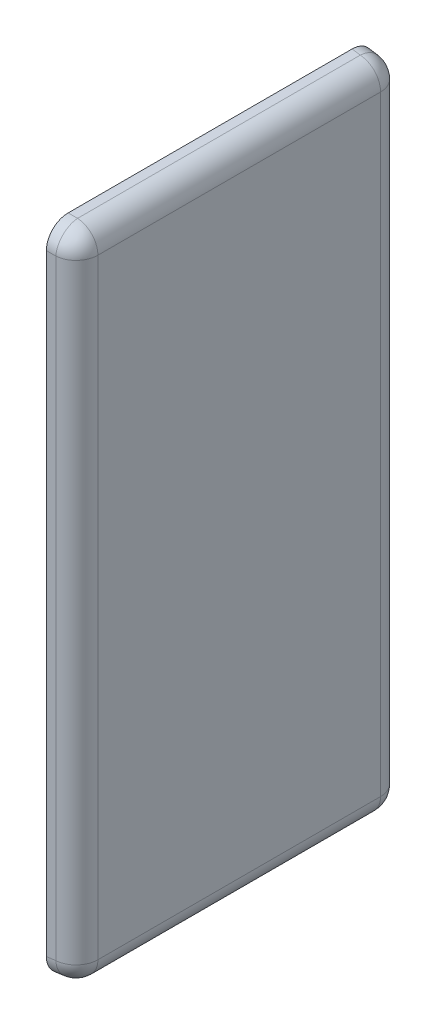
ISO-10303-21;
HEADER;
FILE_DESCRIPTION(('STEP AP214'),'2;1');
FILE_NAME('part.step','',(''),(''),'','','');
FILE_SCHEMA(('AUTOMOTIVE_DESIGN { 1 0 10303 214 1 1 1 1 }'));
ENDSEC;
DATA;
#1=APPLICATION_CONTEXT('core data for automotive mechanical design processes');
#2=APPLICATION_PROTOCOL_DEFINITION('international standard','automotive_design',2000,#1);
#3=PRODUCT_CONTEXT('',#1,'mechanical');
#4=PRODUCT('Part','Part','',(#3));
#5=PRODUCT_RELATED_PRODUCT_CATEGORY('part','',(#4));
#6=PRODUCT_DEFINITION_FORMATION('','',#4);
#7=PRODUCT_DEFINITION_CONTEXT('part definition',#1,'design');
#8=PRODUCT_DEFINITION('design','',#6,#7);
#9=PRODUCT_DEFINITION_SHAPE('','',#8);
#10=(LENGTH_UNIT() NAMED_UNIT(*) SI_UNIT(.MILLI.,.METRE.));
#11=(NAMED_UNIT(*) PLANE_ANGLE_UNIT() SI_UNIT($,.RADIAN.));
#12=(NAMED_UNIT(*) SI_UNIT($,.STERADIAN.) SOLID_ANGLE_UNIT());
#13=UNCERTAINTY_MEASURE_WITH_UNIT(LENGTH_MEASURE(1.E-05),#10,'distance_accuracy_value','');
#14=(GEOMETRIC_REPRESENTATION_CONTEXT(3) GLOBAL_UNCERTAINTY_ASSIGNED_CONTEXT((#13)) GLOBAL_UNIT_ASSIGNED_CONTEXT((#10,
#11,#12)) REPRESENTATION_CONTEXT('',''));
#15=CARTESIAN_POINT('',(0.,0.,0.));
#16=DIRECTION('',(0.,0.,1.));
#17=DIRECTION('',(1.,0.,0.));
#18=AXIS2_PLACEMENT_3D('',#15,#16,#17);
#19=CARTESIAN_POINT('',(1.,0.,0.));
#20=DIRECTION('',(-1.,0.,0.));
#21=DIRECTION('',(0.,0.,1.));
#22=AXIS2_PLACEMENT_3D('',#19,#20,#21);
#23=PLANE('',#22);
#24=CARTESIAN_POINT('',(1.,-30.,-7.5));
#25=DIRECTION('',(1.,0.,0.));
#26=DIRECTION('',(0.,0.,-1.));
#27=AXIS2_PLACEMENT_3D('',#24,#25,#26);
#28=CIRCLE('',#27,0.75);
#29=CARTESIAN_POINT('',(1.,-30.,-8.25));
#30=VERTEX_POINT('',#29);
#31=EDGE_CURVE('E18',#30,#30,#28,.F.);
#32=ORIENTED_EDGE('',*,*,#31,.T.);
#33=EDGE_LOOP('',(#32));
#34=FACE_BOUND('',#33,.T.);
#35=ADVANCED_FACE('F15',(#34),#23,.T.);
#36=CARTESIAN_POINT('',(1.,0.,0.));
#37=DIRECTION('',(-1.,0.,0.));
#38=DIRECTION('',(0.,0.,1.));
#39=AXIS2_PLACEMENT_3D('',#36,#37,#38);
#40=PLANE('',#39);
#41=CARTESIAN_POINT('',(1.,-30.,7.5));
#42=DIRECTION('',(1.,0.,0.));
#43=DIRECTION('',(0.,0.,-1.));
#44=AXIS2_PLACEMENT_3D('',#41,#42,#43);
#45=CIRCLE('',#44,0.75);
#46=CARTESIAN_POINT('',(1.,-30.,6.75));
#47=VERTEX_POINT('',#46);
#48=EDGE_CURVE('E892',#47,#47,#45,.F.);
#49=ORIENTED_EDGE('',*,*,#48,.T.);
#50=EDGE_LOOP('',(#49));
#51=FACE_BOUND('',#50,.T.);
#52=ADVANCED_FACE('F1102',(#51),#40,.T.);
#53=CARTESIAN_POINT('',(1.,0.,0.));
#54=DIRECTION('',(-1.,0.,0.));
#55=DIRECTION('',(0.,0.,1.));
#56=AXIS2_PLACEMENT_3D('',#53,#54,#55);
#57=PLANE('',#56);
#58=CARTESIAN_POINT('',(1.,-15.,-7.5));
#59=DIRECTION('',(1.,0.,0.));
#60=DIRECTION('',(0.,0.,-1.));
#61=AXIS2_PLACEMENT_3D('',#58,#59,#60);
#62=CIRCLE('',#61,0.75);
#63=CARTESIAN_POINT('',(1.,-15.,-8.25));
#64=VERTEX_POINT('',#63);
#65=EDGE_CURVE('E890',#64,#64,#62,.F.);
#66=ORIENTED_EDGE('',*,*,#65,.T.);
#67=EDGE_LOOP('',(#66));
#68=FACE_BOUND('',#67,.T.);
#69=ADVANCED_FACE('F1099',(#68),#57,.T.);
#70=CARTESIAN_POINT('',(1.,0.,0.));
#71=DIRECTION('',(-1.,0.,0.));
#72=DIRECTION('',(0.,0.,1.));
#73=AXIS2_PLACEMENT_3D('',#70,#71,#72);
#74=PLANE('',#73);
#75=CARTESIAN_POINT('',(1.,-15.,7.5));
#76=DIRECTION('',(1.,0.,0.));
#77=DIRECTION('',(0.,0.,-1.));
#78=AXIS2_PLACEMENT_3D('',#75,#76,#77);
#79=CIRCLE('',#78,0.75);
#80=CARTESIAN_POINT('',(1.,-15.,6.75));
#81=VERTEX_POINT('',#80);
#82=EDGE_CURVE('E887',#81,#81,#79,.F.);
#83=ORIENTED_EDGE('',*,*,#82,.T.);
#84=EDGE_LOOP('',(#83));
#85=FACE_BOUND('',#84,.T.);
#86=ADVANCED_FACE('F1095',(#85),#74,.T.);
#87=CARTESIAN_POINT('',(1.,0.,0.));
#88=DIRECTION('',(-1.,0.,0.));
#89=DIRECTION('',(0.,0.,1.));
#90=AXIS2_PLACEMENT_3D('',#87,#88,#89);
#91=PLANE('',#90);
#92=CARTESIAN_POINT('',(1.,15.,-7.5));
#93=DIRECTION('',(1.,0.,0.));
#94=DIRECTION('',(0.,0.,-1.));
#95=AXIS2_PLACEMENT_3D('',#92,#93,#94);
#96=CIRCLE('',#95,0.75);
#97=CARTESIAN_POINT('',(1.,15.,-8.25));
#98=VERTEX_POINT('',#97);
#99=EDGE_CURVE('E884',#98,#98,#96,.F.);
#100=ORIENTED_EDGE('',*,*,#99,.T.);
#101=EDGE_LOOP('',(#100));
#102=FACE_BOUND('',#101,.T.);
#103=ADVANCED_FACE('F1091',(#102),#91,.T.);
#104=CARTESIAN_POINT('',(1.,0.,0.));
#105=DIRECTION('',(-1.,0.,0.));
#106=DIRECTION('',(0.,0.,1.));
#107=AXIS2_PLACEMENT_3D('',#104,#105,#106);
#108=PLANE('',#107);
#109=CARTESIAN_POINT('',(1.,30.,-7.5));
#110=DIRECTION('',(1.,0.,0.));
#111=DIRECTION('',(0.,0.,-1.));
#112=AXIS2_PLACEMENT_3D('',#109,#110,#111);
#113=CIRCLE('',#112,0.75);
#114=CARTESIAN_POINT('',(1.,30.,-8.25));
#115=VERTEX_POINT('',#114);
#116=EDGE_CURVE('E881',#115,#115,#113,.F.);
#117=ORIENTED_EDGE('',*,*,#116,.T.);
#118=EDGE_LOOP('',(#117));
#119=FACE_BOUND('',#118,.T.);
#120=ADVANCED_FACE('F1087',(#119),#108,.T.);
#121=CARTESIAN_POINT('',(1.,0.,0.));
#122=DIRECTION('',(-1.,0.,0.));
#123=DIRECTION('',(0.,0.,1.));
#124=AXIS2_PLACEMENT_3D('',#121,#122,#123);
#125=PLANE('',#124);
#126=CARTESIAN_POINT('',(1.,30.,7.5));
#127=DIRECTION('',(1.,0.,0.));
#128=DIRECTION('',(0.,0.,-1.));
#129=AXIS2_PLACEMENT_3D('',#126,#127,#128);
#130=CIRCLE('',#129,0.75);
#131=CARTESIAN_POINT('',(1.,30.,6.75));
#132=VERTEX_POINT('',#131);
#133=EDGE_CURVE('E878',#132,#132,#130,.F.);
#134=ORIENTED_EDGE('',*,*,#133,.T.);
#135=EDGE_LOOP('',(#134));
#136=FACE_BOUND('',#135,.T.);
#137=ADVANCED_FACE('F1083',(#136),#125,.T.);
#138=CARTESIAN_POINT('',(1.,0.,0.));
#139=DIRECTION('',(-1.,0.,0.));
#140=DIRECTION('',(0.,0.,1.));
#141=AXIS2_PLACEMENT_3D('',#138,#139,#140);
#142=PLANE('',#141);
#143=CARTESIAN_POINT('',(1.,15.,7.5));
#144=DIRECTION('',(1.,0.,0.));
#145=DIRECTION('',(0.,0.,-1.));
#146=AXIS2_PLACEMENT_3D('',#143,#144,#145);
#147=CIRCLE('',#146,0.75);
#148=CARTESIAN_POINT('',(1.,15.,6.75));
#149=VERTEX_POINT('',#148);
#150=EDGE_CURVE('E281',#149,#149,#147,.F.);
#151=ORIENTED_EDGE('',*,*,#150,.T.);
#152=EDGE_LOOP('',(#151));
#153=FACE_BOUND('',#152,.T.);
#154=ADVANCED_FACE('F1079',(#153),#142,.T.);
#155=CARTESIAN_POINT('',(1.,0.,0.));
#156=DIRECTION('',(-1.,0.,0.));
#157=DIRECTION('',(0.,0.,1.));
#158=AXIS2_PLACEMENT_3D('',#155,#156,#157);
#159=PLANE('',#158);
#160=CARTESIAN_POINT('',(0.999999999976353,-22.5,0.));
#161=DIRECTION('',(-1.,0.,0.));
#162=DIRECTION('',(0.,0.,1.));
#163=AXIS2_PLACEMENT_3D('',#160,#161,#162);
#164=CIRCLE('',#163,3.48000000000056);
#165=CARTESIAN_POINT('',(0.999999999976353,-22.5,3.48000000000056));
#166=VERTEX_POINT('',#165);
#167=EDGE_CURVE('E871',#166,#166,#164,.T.);
#168=ORIENTED_EDGE('',*,*,#167,.T.);
#169=EDGE_LOOP('',(#168));
#170=FACE_BOUND('',#169,.T.);
#171=ADVANCED_FACE('F1075',(#170),#159,.T.);
#172=CARTESIAN_POINT('',(1.,0.,0.));
#173=DIRECTION('',(-1.,0.,0.));
#174=DIRECTION('',(0.,0.,1.));
#175=AXIS2_PLACEMENT_3D('',#172,#173,#174);
#176=PLANE('',#175);
#177=CARTESIAN_POINT('',(0.999999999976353,22.5,0.));
#178=DIRECTION('',(-1.,0.,0.));
#179=DIRECTION('',(0.,0.,1.));
#180=AXIS2_PLACEMENT_3D('',#177,#178,#179);
#181=CIRCLE('',#180,3.48000000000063);
#182=CARTESIAN_POINT('',(0.999999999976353,22.5,3.48000000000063));
#183=VERTEX_POINT('',#182);
#184=EDGE_CURVE('E858',#183,#183,#181,.T.);
#185=ORIENTED_EDGE('',*,*,#184,.T.);
#186=EDGE_LOOP('',(#185));
#187=FACE_BOUND('',#186,.T.);
#188=ADVANCED_FACE('F904',(#187),#176,.T.);
#189=CARTESIAN_POINT('',(0.,-30.,-7.5));
#190=DIRECTION('',(1.,0.,0.));
#191=DIRECTION('',(0.,0.,-1.));
#192=AXIS2_PLACEMENT_3D('',#189,#190,#191);
#193=CYLINDRICAL_SURFACE('',#192,0.75);
#194=ORIENTED_EDGE('',*,*,#31,.F.);
#195=EDGE_LOOP('',(#194));
#196=FACE_BOUND('',#195,.T.);
#197=CARTESIAN_POINT('',(0.,-30.,-7.5));
#198=DIRECTION('',(1.,0.,0.));
#199=DIRECTION('',(0.,0.,-1.));
#200=AXIS2_PLACEMENT_3D('',#197,#198,#199);
#201=CIRCLE('',#200,0.75);
#202=CARTESIAN_POINT('',(0.,-30.,-8.25));
#203=VERTEX_POINT('',#202);
#204=EDGE_CURVE('E845',#203,#203,#201,.T.);
#205=ORIENTED_EDGE('',*,*,#204,.F.);
#206=EDGE_LOOP('',(#205));
#207=FACE_BOUND('',#206,.T.);
#208=ADVANCED_FACE('F900',(#196,#207),#193,.F.);
#209=CARTESIAN_POINT('',(0.,-30.,7.5));
#210=DIRECTION('',(1.,0.,0.));
#211=DIRECTION('',(0.,0.,-1.));
#212=AXIS2_PLACEMENT_3D('',#209,#210,#211);
#213=CYLINDRICAL_SURFACE('',#212,0.75);
#214=ORIENTED_EDGE('',*,*,#48,.F.);
#215=EDGE_LOOP('',(#214));
#216=FACE_BOUND('',#215,.T.);
#217=CARTESIAN_POINT('',(0.,-30.,7.5));
#218=DIRECTION('',(1.,0.,0.));
#219=DIRECTION('',(0.,0.,-1.));
#220=AXIS2_PLACEMENT_3D('',#217,#218,#219);
#221=CIRCLE('',#220,0.75);
#222=CARTESIAN_POINT('',(0.,-30.,6.75));
#223=VERTEX_POINT('',#222);
#224=EDGE_CURVE('E849',#223,#223,#221,.T.);
#225=ORIENTED_EDGE('',*,*,#224,.F.);
#226=EDGE_LOOP('',(#225));
#227=FACE_BOUND('',#226,.T.);
#228=ADVANCED_FACE('F903',(#216,#227),#213,.F.);
#229=CARTESIAN_POINT('',(0.,-15.,-7.5));
#230=DIRECTION('',(1.,0.,0.));
#231=DIRECTION('',(0.,0.,-1.));
#232=AXIS2_PLACEMENT_3D('',#229,#230,#231);
#233=CYLINDRICAL_SURFACE('',#232,0.75);
#234=ORIENTED_EDGE('',*,*,#65,.F.);
#235=EDGE_LOOP('',(#234));
#236=FACE_BOUND('',#235,.T.);
#237=CARTESIAN_POINT('',(0.,-15.,-7.5));
#238=DIRECTION('',(1.,0.,0.));
#239=DIRECTION('',(0.,0.,-1.));
#240=AXIS2_PLACEMENT_3D('',#237,#238,#239);
#241=CIRCLE('',#240,0.75);
#242=CARTESIAN_POINT('',(0.,-15.,-8.25));
#243=VERTEX_POINT('',#242);
#244=EDGE_CURVE('E1767',#243,#243,#241,.T.);
#245=ORIENTED_EDGE('',*,*,#244,.F.);
#246=EDGE_LOOP('',(#245));
#247=FACE_BOUND('',#246,.T.);
#248=ADVANCED_FACE('F1065',(#236,#247),#233,.F.);
#249=CARTESIAN_POINT('',(0.,-15.,7.5));
#250=DIRECTION('',(1.,0.,0.));
#251=DIRECTION('',(0.,0.,-1.));
#252=AXIS2_PLACEMENT_3D('',#249,#250,#251);
#253=CYLINDRICAL_SURFACE('',#252,0.75);
#254=ORIENTED_EDGE('',*,*,#82,.F.);
#255=EDGE_LOOP('',(#254));
#256=FACE_BOUND('',#255,.T.);
#257=CARTESIAN_POINT('',(0.,-15.,7.5));
#258=DIRECTION('',(1.,0.,0.));
#259=DIRECTION('',(0.,0.,-1.));
#260=AXIS2_PLACEMENT_3D('',#257,#258,#259);
#261=CIRCLE('',#260,0.75);
#262=CARTESIAN_POINT('',(0.,-15.,6.75));
#263=VERTEX_POINT('',#262);
#264=EDGE_CURVE('E1768',#263,#263,#261,.T.);
#265=ORIENTED_EDGE('',*,*,#264,.F.);
#266=EDGE_LOOP('',(#265));
#267=FACE_BOUND('',#266,.T.);
#268=ADVANCED_FACE('F1061',(#256,#267),#253,.F.);
#269=CARTESIAN_POINT('',(0.,15.,-7.5));
#270=DIRECTION('',(1.,0.,0.));
#271=DIRECTION('',(0.,0.,-1.));
#272=AXIS2_PLACEMENT_3D('',#269,#270,#271);
#273=CYLINDRICAL_SURFACE('',#272,0.75);
#274=CARTESIAN_POINT('',(0.,15.,-7.5));
#275=DIRECTION('',(1.,0.,0.));
#276=DIRECTION('',(0.,0.,-1.));
#277=AXIS2_PLACEMENT_3D('',#274,#275,#276);
#278=CIRCLE('',#277,0.75);
#279=CARTESIAN_POINT('',(0.,15.,-8.25));
#280=VERTEX_POINT('',#279);
#281=EDGE_CURVE('E1771',#280,#280,#278,.T.);
#282=ORIENTED_EDGE('',*,*,#281,.F.);
#283=EDGE_LOOP('',(#282));
#284=FACE_BOUND('',#283,.T.);
#285=ORIENTED_EDGE('',*,*,#99,.F.);
#286=EDGE_LOOP('',(#285));
#287=FACE_BOUND('',#286,.T.);
#288=ADVANCED_FACE('F1057',(#284,#287),#273,.F.);
#289=CARTESIAN_POINT('',(0.,30.,-7.5));
#290=DIRECTION('',(1.,0.,0.));
#291=DIRECTION('',(0.,0.,-1.));
#292=AXIS2_PLACEMENT_3D('',#289,#290,#291);
#293=CYLINDRICAL_SURFACE('',#292,0.75);
#294=CARTESIAN_POINT('',(0.,30.,-7.5));
#295=DIRECTION('',(1.,0.,0.));
#296=DIRECTION('',(0.,0.,-1.));
#297=AXIS2_PLACEMENT_3D('',#294,#295,#296);
#298=CIRCLE('',#297,0.75);
#299=CARTESIAN_POINT('',(0.,30.,-8.25));
#300=VERTEX_POINT('',#299);
#301=EDGE_CURVE('E1777',#300,#300,#298,.T.);
#302=ORIENTED_EDGE('',*,*,#301,.F.);
#303=EDGE_LOOP('',(#302));
#304=FACE_BOUND('',#303,.T.);
#305=ORIENTED_EDGE('',*,*,#116,.F.);
#306=EDGE_LOOP('',(#305));
#307=FACE_BOUND('',#306,.T.);
#308=ADVANCED_FACE('F1053',(#304,#307),#293,.F.);
#309=CARTESIAN_POINT('',(0.,30.,7.5));
#310=DIRECTION('',(1.,0.,0.));
#311=DIRECTION('',(0.,0.,-1.));
#312=AXIS2_PLACEMENT_3D('',#309,#310,#311);
#313=CYLINDRICAL_SURFACE('',#312,0.75);
#314=CARTESIAN_POINT('',(0.,30.,7.5));
#315=DIRECTION('',(1.,0.,0.));
#316=DIRECTION('',(0.,0.,-1.));
#317=AXIS2_PLACEMENT_3D('',#314,#315,#316);
#318=CIRCLE('',#317,0.75);
#319=CARTESIAN_POINT('',(0.,30.,6.75));
#320=VERTEX_POINT('',#319);
#321=EDGE_CURVE('E946',#320,#320,#318,.T.);
#322=ORIENTED_EDGE('',*,*,#321,.F.);
#323=EDGE_LOOP('',(#322));
#324=FACE_BOUND('',#323,.T.);
#325=ORIENTED_EDGE('',*,*,#133,.F.);
#326=EDGE_LOOP('',(#325));
#327=FACE_BOUND('',#326,.T.);
#328=ADVANCED_FACE('F1049',(#324,#327),#313,.F.);
#329=CARTESIAN_POINT('',(0.,15.,7.5));
#330=DIRECTION('',(1.,0.,0.));
#331=DIRECTION('',(0.,0.,-1.));
#332=AXIS2_PLACEMENT_3D('',#329,#330,#331);
#333=CYLINDRICAL_SURFACE('',#332,0.75);
#334=CARTESIAN_POINT('',(0.,15.,7.5));
#335=DIRECTION('',(1.,0.,0.));
#336=DIRECTION('',(0.,0.,-1.));
#337=AXIS2_PLACEMENT_3D('',#334,#335,#336);
#338=CIRCLE('',#337,0.75);
#339=CARTESIAN_POINT('',(0.,15.,6.75));
#340=VERTEX_POINT('',#339);
#341=EDGE_CURVE('E350',#340,#340,#338,.T.);
#342=ORIENTED_EDGE('',*,*,#341,.F.);
#343=EDGE_LOOP('',(#342));
#344=FACE_BOUND('',#343,.T.);
#345=ORIENTED_EDGE('',*,*,#150,.F.);
#346=EDGE_LOOP('',(#345));
#347=FACE_BOUND('',#346,.T.);
#348=ADVANCED_FACE('F1044',(#344,#347),#333,.F.);
#349=CARTESIAN_POINT('',(0.5,-22.,7.5));
#350=DIRECTION('',(1.,0.,0.));
#351=DIRECTION('',(0.,0.,-1.));
#352=AXIS2_PLACEMENT_3D('',#349,#350,#351);
#353=PLANE('',#352);
#354=DIRECTION('',(0.,0.,-1.));
#355=VECTOR('',#354,1.);
#356=CARTESIAN_POINT('',(0.5,-23.,7.5));
#357=LINE('',#356,#355);
#358=CARTESIAN_POINT('',(0.5,-23.,-5.32658427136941));
#359=VERTEX_POINT('',#358);
#360=CARTESIAN_POINT('',(0.499999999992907,-23.,-3.45399768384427));
#361=VERTEX_POINT('',#360);
#362=EDGE_CURVE('E275',#359,#361,#357,.F.);
#363=ORIENTED_EDGE('',*,*,#362,.T.);
#364=CARTESIAN_POINT('',(0.499999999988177,-22.5,0.));
#365=DIRECTION('',(-1.,0.,0.));
#366=DIRECTION('',(0.,0.,1.));
#367=AXIS2_PLACEMENT_3D('',#364,#365,#366);
#368=CIRCLE('',#367,3.49000000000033);
#369=CARTESIAN_POINT('',(0.499999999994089,-22.,-3.45399768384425));
#370=VERTEX_POINT('',#369);
#371=EDGE_CURVE('E269',#370,#361,#368,.T.);
#372=ORIENTED_EDGE('',*,*,#371,.F.);
#373=DIRECTION('',(0.,0.,1.));
#374=VECTOR('',#373,1.);
#375=CARTESIAN_POINT('',(0.5,-22.,7.5));
#376=LINE('',#375,#374);
#377=CARTESIAN_POINT('',(0.5,-22.,-5.32658427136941));
#378=VERTEX_POINT('',#377);
#379=EDGE_CURVE('E272',#370,#378,#376,.F.);
#380=ORIENTED_EDGE('',*,*,#379,.T.);
#381=CARTESIAN_POINT('',(0.5,-22.5,0.));
#382=DIRECTION('',(-1.,0.,0.));
#383=DIRECTION('',(0.,0.,1.));
#384=AXIS2_PLACEMENT_3D('',#381,#382,#383);
#385=CIRCLE('',#384,5.35);
#386=EDGE_CURVE('E280',#359,#378,#385,.F.);
#387=ORIENTED_EDGE('',*,*,#386,.F.);
#388=EDGE_LOOP('',(#363,#372,#380,#387));
#389=FACE_BOUND('',#388,.T.);
#390=ADVANCED_FACE('F271',(#389),#353,.F.);
#391=CARTESIAN_POINT('',(-10.,-22.5,0.));
#392=DIRECTION('',(1.,0.,0.));
#393=DIRECTION('',(0.,0.,-1.));
#394=AXIS2_PLACEMENT_3D('',#391,#392,#393);
#395=PLANE('',#394);
#396=DIRECTION('',(0.,0.,1.));
#397=VECTOR('',#396,1.);
#398=CARTESIAN_POINT('',(-10.,-22.,7.5));
#399=LINE('',#398,#397);
#400=CARTESIAN_POINT('',(-9.99999999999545,-22.,-4.51857298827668));
#401=VERTEX_POINT('',#400);
#402=CARTESIAN_POINT('',(-9.99999999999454,-22.,-3.66606055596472));
#403=VERTEX_POINT('',#402);
#404=EDGE_CURVE('E292',#401,#403,#399,.T.);
#405=ORIENTED_EDGE('',*,*,#404,.T.);
#406=CARTESIAN_POINT('',(-9.99999999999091,-22.5,0.));
#407=DIRECTION('',(-1.,0.,0.));
#408=DIRECTION('',(0.,0.,1.));
#409=AXIS2_PLACEMENT_3D('',#406,#407,#408);
#410=CIRCLE('',#409,3.69999999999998);
#411=CARTESIAN_POINT('',(-9.99999999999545,-22.,3.66606055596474));
#412=VERTEX_POINT('',#411);
#413=EDGE_CURVE('E298',#403,#412,#410,.F.);
#414=ORIENTED_EDGE('',*,*,#413,.T.);
#415=DIRECTION('',(0.,0.,-1.));
#416=VECTOR('',#415,1.);
#417=CARTESIAN_POINT('',(-10.,-22.,0.));
#418=LINE('',#417,#416);
#419=CARTESIAN_POINT('',(-9.99999999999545,-22.,4.51857298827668));
#420=VERTEX_POINT('',#419);
#421=EDGE_CURVE('E712',#420,#412,#418,.T.);
#422=ORIENTED_EDGE('',*,*,#421,.F.);
#423=CARTESIAN_POINT('',(-9.99999999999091,-22.5,0.));
#424=DIRECTION('',(1.,0.,0.));
#425=DIRECTION('',(0.,0.,-1.));
#426=AXIS2_PLACEMENT_3D('',#423,#424,#425);
#427=CIRCLE('',#426,4.5461524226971);
#428=EDGE_CURVE('E1036',#401,#420,#427,.T.);
#429=ORIENTED_EDGE('',*,*,#428,.F.);
#430=EDGE_LOOP('',(#405,#414,#422,#429));
#431=FACE_BOUND('',#430,.T.);
#432=ADVANCED_FACE('F1035',(#431),#395,.F.);
#433=CARTESIAN_POINT('',(0.5,-22.,7.5));
#434=DIRECTION('',(1.,0.,0.));
#435=DIRECTION('',(0.,0.,-1.));
#436=AXIS2_PLACEMENT_3D('',#433,#434,#435);
#437=PLANE('',#436);
#438=DIRECTION('',(0.,0.,-1.));
#439=VECTOR('',#438,1.);
#440=CARTESIAN_POINT('',(0.5,-23.,7.5));
#441=LINE('',#440,#439);
#442=CARTESIAN_POINT('',(0.499999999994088,-23.,3.45399768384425));
#443=VERTEX_POINT('',#442);
#444=CARTESIAN_POINT('',(0.5,-23.,5.32658427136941));
#445=VERTEX_POINT('',#444);
#446=EDGE_CURVE('E389',#443,#445,#441,.F.);
#447=ORIENTED_EDGE('',*,*,#446,.T.);
#448=CARTESIAN_POINT('',(0.5,-22.5,0.));
#449=DIRECTION('',(-1.,0.,0.));
#450=DIRECTION('',(0.,0.,1.));
#451=AXIS2_PLACEMENT_3D('',#448,#449,#450);
#452=CIRCLE('',#451,5.35);
#453=CARTESIAN_POINT('',(0.5,-22.,5.32658427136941));
#454=VERTEX_POINT('',#453);
#455=EDGE_CURVE('E714',#454,#445,#452,.F.);
#456=ORIENTED_EDGE('',*,*,#455,.F.);
#457=DIRECTION('',(0.,0.,1.));
#458=VECTOR('',#457,1.);
#459=CARTESIAN_POINT('',(0.5,-22.,7.5));
#460=LINE('',#459,#458);
#461=CARTESIAN_POINT('',(0.499999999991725,-22.,3.4539976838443));
#462=VERTEX_POINT('',#461);
#463=EDGE_CURVE('E390',#454,#462,#460,.F.);
#464=ORIENTED_EDGE('',*,*,#463,.T.);
#465=CARTESIAN_POINT('',(0.499999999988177,-22.5,0.));
#466=DIRECTION('',(-1.,0.,0.));
#467=DIRECTION('',(0.,0.,1.));
#468=AXIS2_PLACEMENT_3D('',#465,#466,#467);
#469=CIRCLE('',#468,3.49000000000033);
#470=EDGE_CURVE('E867',#462,#443,#469,.F.);
#471=ORIENTED_EDGE('',*,*,#470,.T.);
#472=EDGE_LOOP('',(#447,#456,#464,#471));
#473=FACE_BOUND('',#472,.T.);
#474=ADVANCED_FACE('F1029',(#473),#437,.F.);
#475=CARTESIAN_POINT('',(-10.0000000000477,-22.5,0.));
#476=DIRECTION('',(-1.,0.,0.));
#477=DIRECTION('',(0.,0.,1.));
#478=AXIS2_PLACEMENT_3D('',#475,#476,#477);
#479=CONICAL_SURFACE('',#478,3.70000000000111,0.019997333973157);
#480=ORIENTED_EDGE('',*,*,#413,.F.);
#481=CARTESIAN_POINT('',(-9.99999999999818,-22.,-3.66606055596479));
#482=CARTESIAN_POINT('',(-7.58218235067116,-22.,-3.61725767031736));
#483=CARTESIAN_POINT('',(-5.16436509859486,-22.,-3.5684351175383));
#484=CARTESIAN_POINT('',(-1.66436541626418,-22.,-3.4977317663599));
#485=CARTESIAN_POINT('',(-0.582182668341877,-22.,-3.47586669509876));
#486=CARTESIAN_POINT('',(0.499999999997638,-22.,-3.45399768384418));
#487=B_SPLINE_CURVE_WITH_KNOTS('',3,(#481,#482,#483,#484,#485,#486),.UNSPECIFIED.,.F.,.F.,(4,2,
4),(0.,7.25493040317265,10.5021412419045),.UNSPECIFIED.);
#488=EDGE_CURVE('E288',#403,#370,#487,.T.);
#489=ORIENTED_EDGE('',*,*,#488,.T.);
#490=ORIENTED_EDGE('',*,*,#371,.T.);
#491=CARTESIAN_POINT('',(0.499999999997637,-23.,-3.45399768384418));
#492=CARTESIAN_POINT('',(-1.78058908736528,-23.,-3.50008384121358));
#493=CARTESIAN_POINT('',(-4.06117852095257,-23.,-3.5461528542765));
#494=CARTESIAN_POINT('',(-7.56117876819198,-23.,-3.61682823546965));
#495=CARTESIAN_POINT('',(-8.7805893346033,-23.,-3.64144684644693));
#496=CARTESIAN_POINT('',(-9.99999999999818,-23.,-3.66606055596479));
#497=B_SPLINE_CURVE_WITH_KNOTS('',3,(#491,#492,#493,#494,#495,#496),.UNSPECIFIED.,.F.,.F.,(4,2,
4),(0.,6.8431640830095,10.5021412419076),.UNSPECIFIED.);
#498=CARTESIAN_POINT('',(-9.99999999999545,-23.,-3.66606055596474));
#499=VERTEX_POINT('',#498);
#500=EDGE_CURVE('E302',#361,#499,#497,.T.);
#501=ORIENTED_EDGE('',*,*,#500,.T.);
#502=CARTESIAN_POINT('',(-9.99999999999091,-22.5,0.));
#503=DIRECTION('',(-1.,0.,0.));
#504=DIRECTION('',(0.,0.,1.));
#505=AXIS2_PLACEMENT_3D('',#502,#503,#504);
#506=CIRCLE('',#505,3.69999999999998);
#507=CARTESIAN_POINT('',(-9.99999999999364,-23.,3.6660605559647));
#508=VERTEX_POINT('',#507);
#509=EDGE_CURVE('E865',#499,#508,#506,.T.);
#510=ORIENTED_EDGE('',*,*,#509,.T.);
#511=CARTESIAN_POINT('',(-9.99999999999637,-23.,3.66606055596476));
#512=CARTESIAN_POINT('',(-7.58218235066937,-23.,3.61725767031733));
#513=CARTESIAN_POINT('',(-5.1643650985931,-23.,3.56843511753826));
#514=CARTESIAN_POINT('',(-1.66436541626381,-23.,3.4977317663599));
#515=CARTESIAN_POINT('',(-0.582182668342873,-23.,3.47586669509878));
#516=CARTESIAN_POINT('',(0.499999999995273,-23.,3.45399768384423));
#517=B_SPLINE_CURVE_WITH_KNOTS('',3,(#511,#512,#513,#514,#515,#516),.UNSPECIFIED.,.F.,.F.,(4,2,
4),(0.,7.25493040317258,10.5021412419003),.UNSPECIFIED.);
#518=EDGE_CURVE('E374',#508,#443,#517,.T.);
#519=ORIENTED_EDGE('',*,*,#518,.T.);
#520=ORIENTED_EDGE('',*,*,#470,.F.);
#521=CARTESIAN_POINT('',(0.499999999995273,-22.,3.45399768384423));
#522=CARTESIAN_POINT('',(-1.78058908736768,-22.,3.50008384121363));
#523=CARTESIAN_POINT('',(-4.061178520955,-22.,3.54615285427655));
#524=CARTESIAN_POINT('',(-7.56117876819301,-22.,3.61682823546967));
#525=CARTESIAN_POINT('',(-8.7805893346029,-22.,3.64144684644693));
#526=CARTESIAN_POINT('',(-9.99999999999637,-22.,3.66606055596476));
#527=B_SPLINE_CURVE_WITH_KNOTS('',3,(#521,#522,#523,#524,#525,#526),.UNSPECIFIED.,.F.,.F.,(4,2,
4),(0.,6.8431640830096,10.5021412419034),.UNSPECIFIED.);
#528=EDGE_CURVE('E383',#462,#412,#527,.T.);
#529=ORIENTED_EDGE('',*,*,#528,.T.);
#530=EDGE_LOOP('',(#480,#489,#490,#501,#510,#519,#520,#529));
#531=FACE_BOUND('',#530,.T.);
#532=ORIENTED_EDGE('',*,*,#167,.F.);
#533=EDGE_LOOP('',(#532));
#534=FACE_BOUND('',#533,.T.);
#535=ADVANCED_FACE('F294',(#531,#534),#479,.F.);
#536=CARTESIAN_POINT('',(-10.,-22.5,0.));
#537=DIRECTION('',(1.,0.,0.));
#538=DIRECTION('',(0.,0.,-1.));
#539=AXIS2_PLACEMENT_3D('',#536,#537,#538);
#540=PLANE('',#539);
#541=DIRECTION('',(0.,0.,-1.));
#542=VECTOR('',#541,1.);
#543=CARTESIAN_POINT('',(-10.,-23.,7.5));
#544=LINE('',#543,#542);
#545=CARTESIAN_POINT('',(-9.99999999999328,-23.,-4.51857298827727));
#546=VERTEX_POINT('',#545);
#547=EDGE_CURVE('E299',#499,#546,#544,.T.);
#548=ORIENTED_EDGE('',*,*,#547,.T.);
#549=CARTESIAN_POINT('',(-9.99999999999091,-22.5,0.));
#550=DIRECTION('',(1.,0.,0.));
#551=DIRECTION('',(0.,0.,-1.));
#552=AXIS2_PLACEMENT_3D('',#549,#550,#551);
#553=CIRCLE('',#552,4.5461524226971);
#554=CARTESIAN_POINT('',(-9.99999999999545,-23.,4.51857298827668));
#555=VERTEX_POINT('',#554);
#556=EDGE_CURVE('E373',#555,#546,#553,.T.);
#557=ORIENTED_EDGE('',*,*,#556,.F.);
#558=DIRECTION('',(0.,0.,-1.));
#559=VECTOR('',#558,1.);
#560=CARTESIAN_POINT('',(-10.,-23.,7.5));
#561=LINE('',#560,#559);
#562=EDGE_CURVE('E382',#555,#508,#561,.T.);
#563=ORIENTED_EDGE('',*,*,#562,.T.);
#564=ORIENTED_EDGE('',*,*,#509,.F.);
#565=EDGE_LOOP('',(#548,#557,#563,#564));
#566=FACE_BOUND('',#565,.T.);
#567=ADVANCED_FACE('F1026',(#566),#540,.F.);
#568=CARTESIAN_POINT('',(0.5,23.,7.5));
#569=DIRECTION('',(1.,0.,0.));
#570=DIRECTION('',(0.,0.,-1.));
#571=AXIS2_PLACEMENT_3D('',#568,#569,#570);
#572=PLANE('',#571);
#573=DIRECTION('',(0.,0.,-1.));
#574=VECTOR('',#573,1.);
#575=CARTESIAN_POINT('',(0.5,22.,7.5));
#576=LINE('',#575,#574);
#577=CARTESIAN_POINT('',(0.5,22.,-5.32658427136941));
#578=VERTEX_POINT('',#577);
#579=CARTESIAN_POINT('',(0.499999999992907,22.,-3.45399768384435));
#580=VERTEX_POINT('',#579);
#581=EDGE_CURVE('E625',#578,#580,#576,.F.);
#582=ORIENTED_EDGE('',*,*,#581,.T.);
#583=CARTESIAN_POINT('',(0.499999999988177,22.5,0.));
#584=DIRECTION('',(-1.,0.,0.));
#585=DIRECTION('',(0.,0.,1.));
#586=AXIS2_PLACEMENT_3D('',#583,#584,#585);
#587=CIRCLE('',#586,3.4900000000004);
#588=CARTESIAN_POINT('',(0.499999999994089,23.,-3.45399768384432));
#589=VERTEX_POINT('',#588);
#590=EDGE_CURVE('E863',#589,#580,#587,.T.);
#591=ORIENTED_EDGE('',*,*,#590,.F.);
#592=DIRECTION('',(0.,0.,1.));
#593=VECTOR('',#592,1.);
#594=CARTESIAN_POINT('',(0.5,23.,7.5));
#595=LINE('',#594,#593);
#596=CARTESIAN_POINT('',(0.5,23.,-5.32658427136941));
#597=VERTEX_POINT('',#596);
#598=EDGE_CURVE('E698',#589,#597,#595,.F.);
#599=ORIENTED_EDGE('',*,*,#598,.T.);
#600=CARTESIAN_POINT('',(0.5,22.5,0.));
#601=DIRECTION('',(-1.,0.,0.));
#602=DIRECTION('',(0.,0.,1.));
#603=AXIS2_PLACEMENT_3D('',#600,#601,#602);
#604=CIRCLE('',#603,5.35);
#605=EDGE_CURVE('E693',#578,#597,#604,.F.);
#606=ORIENTED_EDGE('',*,*,#605,.F.);
#607=EDGE_LOOP('',(#582,#591,#599,#606));
#608=FACE_BOUND('',#607,.T.);
#609=ADVANCED_FACE('F1247',(#608),#572,.F.);
#610=CARTESIAN_POINT('',(-10.,22.5,0.));
#611=DIRECTION('',(1.,0.,0.));
#612=DIRECTION('',(0.,0.,-1.));
#613=AXIS2_PLACEMENT_3D('',#610,#611,#612);
#614=PLANE('',#613);
#615=DIRECTION('',(0.,0.,1.));
#616=VECTOR('',#615,1.);
#617=CARTESIAN_POINT('',(-10.,23.,7.5));
#618=LINE('',#617,#616);
#619=CARTESIAN_POINT('',(-9.99999999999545,23.,-4.5185729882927));
#620=VERTEX_POINT('',#619);
#621=CARTESIAN_POINT('',(-9.99999999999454,23.,-3.66606055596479));
#622=VERTEX_POINT('',#621);
#623=EDGE_CURVE('E694',#620,#622,#618,.T.);
#624=ORIENTED_EDGE('',*,*,#623,.T.);
#625=CARTESIAN_POINT('',(-9.99999999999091,22.5,0.));
#626=DIRECTION('',(-1.,0.,0.));
#627=DIRECTION('',(0.,0.,1.));
#628=AXIS2_PLACEMENT_3D('',#625,#626,#627);
#629=CIRCLE('',#628,3.70000000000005);
#630=CARTESIAN_POINT('',(-9.99999999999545,23.,3.66606055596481));
#631=VERTEX_POINT('',#630);
#632=EDGE_CURVE('E852',#622,#631,#629,.F.);
#633=ORIENTED_EDGE('',*,*,#632,.T.);
#634=DIRECTION('',(0.,0.,-1.));
#635=VECTOR('',#634,1.);
#636=CARTESIAN_POINT('',(-10.,23.,0.));
#637=LINE('',#636,#635);
#638=CARTESIAN_POINT('',(-9.99999999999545,23.,4.5185729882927));
#639=VERTEX_POINT('',#638);
#640=EDGE_CURVE('E690',#639,#631,#637,.T.);
#641=ORIENTED_EDGE('',*,*,#640,.F.);
#642=CARTESIAN_POINT('',(-9.99999999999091,22.5,0.));
#643=DIRECTION('',(1.,0.,0.));
#644=DIRECTION('',(0.,0.,-1.));
#645=AXIS2_PLACEMENT_3D('',#642,#643,#644);
#646=CIRCLE('',#645,4.54615242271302);
#647=EDGE_CURVE('E1740',#620,#639,#646,.T.);
#648=ORIENTED_EDGE('',*,*,#647,.F.);
#649=EDGE_LOOP('',(#624,#633,#641,#648));
#650=FACE_BOUND('',#649,.T.);
#651=ADVANCED_FACE('F1255',(#650),#614,.F.);
#652=CARTESIAN_POINT('',(0.5,23.,7.5));
#653=DIRECTION('',(1.,0.,0.));
#654=DIRECTION('',(0.,0.,-1.));
#655=AXIS2_PLACEMENT_3D('',#652,#653,#654);
#656=PLANE('',#655);
#657=DIRECTION('',(0.,0.,-1.));
#658=VECTOR('',#657,1.);
#659=CARTESIAN_POINT('',(0.5,22.,7.5));
#660=LINE('',#659,#658);
#661=CARTESIAN_POINT('',(0.499999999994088,22.,3.45399768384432));
#662=VERTEX_POINT('',#661);
#663=CARTESIAN_POINT('',(0.5,22.,5.32658427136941));
#664=VERTEX_POINT('',#663);
#665=EDGE_CURVE('E672',#662,#664,#660,.F.);
#666=ORIENTED_EDGE('',*,*,#665,.T.);
#667=CARTESIAN_POINT('',(0.5,22.5,0.));
#668=DIRECTION('',(-1.,0.,0.));
#669=DIRECTION('',(0.,0.,1.));
#670=AXIS2_PLACEMENT_3D('',#667,#668,#669);
#671=CIRCLE('',#670,5.35);
#672=CARTESIAN_POINT('',(0.5,23.,5.32658427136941));
#673=VERTEX_POINT('',#672);
#674=EDGE_CURVE('E692',#673,#664,#671,.F.);
#675=ORIENTED_EDGE('',*,*,#674,.F.);
#676=DIRECTION('',(0.,0.,1.));
#677=VECTOR('',#676,1.);
#678=CARTESIAN_POINT('',(0.5,23.,7.5));
#679=LINE('',#678,#677);
#680=CARTESIAN_POINT('',(0.499999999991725,23.,3.45399768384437));
#681=VERTEX_POINT('',#680);
#682=EDGE_CURVE('E681',#673,#681,#679,.F.);
#683=ORIENTED_EDGE('',*,*,#682,.T.);
#684=CARTESIAN_POINT('',(0.499999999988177,22.5,0.));
#685=DIRECTION('',(-1.,0.,0.));
#686=DIRECTION('',(0.,0.,1.));
#687=AXIS2_PLACEMENT_3D('',#684,#685,#686);
#688=CIRCLE('',#687,3.4900000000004);
#689=EDGE_CURVE('E846',#681,#662,#688,.F.);
#690=ORIENTED_EDGE('',*,*,#689,.T.);
#691=EDGE_LOOP('',(#666,#675,#683,#690));
#692=FACE_BOUND('',#691,.T.);
#693=ADVANCED_FACE('F647',(#692),#656,.F.);
#694=CARTESIAN_POINT('',(-10.0000000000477,22.5,0.));
#695=DIRECTION('',(-1.,0.,0.));
#696=DIRECTION('',(0.,0.,1.));
#697=AXIS2_PLACEMENT_3D('',#694,#695,#696);
#698=CONICAL_SURFACE('',#697,3.70000000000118,0.019997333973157);
#699=ORIENTED_EDGE('',*,*,#632,.F.);
#700=CARTESIAN_POINT('',(-9.99999999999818,23.,-3.66606055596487));
#701=CARTESIAN_POINT('',(-7.58218235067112,23.,-3.61725767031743));
#702=CARTESIAN_POINT('',(-5.16436509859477,23.,-3.56843511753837));
#703=CARTESIAN_POINT('',(-1.66436541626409,23.,-3.49773176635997));
#704=CARTESIAN_POINT('',(-0.582182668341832,23.,-3.47586669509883));
#705=CARTESIAN_POINT('',(0.499999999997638,23.,-3.45399768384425));
#706=B_SPLINE_CURVE_WITH_KNOTS('',3,(#700,#701,#702,#703,#704,#705),.UNSPECIFIED.,.F.,.F.,(4,2,
4),(0.,7.25493040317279,10.5021412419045),.UNSPECIFIED.);
#707=EDGE_CURVE('E635',#622,#589,#706,.T.);
#708=ORIENTED_EDGE('',*,*,#707,.T.);
#709=ORIENTED_EDGE('',*,*,#590,.T.);
#710=CARTESIAN_POINT('',(0.499999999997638,22.,-3.45399768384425));
#711=CARTESIAN_POINT('',(-1.78058908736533,22.,-3.50008384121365));
#712=CARTESIAN_POINT('',(-4.06117852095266,22.,-3.54615285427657));
#713=CARTESIAN_POINT('',(-7.56117876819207,22.,-3.61682823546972));
#714=CARTESIAN_POINT('',(-8.78058933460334,22.,-3.641446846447));
#715=CARTESIAN_POINT('',(-9.99999999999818,22.,-3.66606055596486));
#716=B_SPLINE_CURVE_WITH_KNOTS('',3,(#710,#711,#712,#713,#714,#715),.UNSPECIFIED.,.F.,.F.,(4,2,
4),(0.,6.84316408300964,10.5021412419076),.UNSPECIFIED.);
#717=CARTESIAN_POINT('',(-9.99999999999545,22.,-3.66606055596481));
#718=VERTEX_POINT('',#717);
#719=EDGE_CURVE('E626',#580,#718,#716,.T.);
#720=ORIENTED_EDGE('',*,*,#719,.T.);
#721=CARTESIAN_POINT('',(-9.99999999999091,22.5,0.));
#722=DIRECTION('',(-1.,0.,0.));
#723=DIRECTION('',(0.,0.,1.));
#724=AXIS2_PLACEMENT_3D('',#721,#722,#723);
#725=CIRCLE('',#724,3.70000000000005);
#726=CARTESIAN_POINT('',(-9.99999999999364,22.,3.66606055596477));
#727=VERTEX_POINT('',#726);
#728=EDGE_CURVE('E844',#718,#727,#725,.T.);
#729=ORIENTED_EDGE('',*,*,#728,.T.);
#730=CARTESIAN_POINT('',(-9.99999999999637,22.,3.66606055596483));
#731=CARTESIAN_POINT('',(-7.58218235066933,22.,3.61725767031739));
#732=CARTESIAN_POINT('',(-5.164365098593,22.,3.56843511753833));
#733=CARTESIAN_POINT('',(-1.66436541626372,22.,3.49773176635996));
#734=CARTESIAN_POINT('',(-0.582182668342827,22.,3.47586669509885));
#735=CARTESIAN_POINT('',(0.499999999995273,22.,3.4539976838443));
#736=B_SPLINE_CURVE_WITH_KNOTS('',3,(#730,#731,#732,#733,#734,#735),.UNSPECIFIED.,.F.,.F.,(4,2,
4),(0.,7.25493040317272,10.5021412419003),.UNSPECIFIED.);
#737=EDGE_CURVE('E661',#727,#662,#736,.T.);
#738=ORIENTED_EDGE('',*,*,#737,.T.);
#739=ORIENTED_EDGE('',*,*,#689,.F.);
#740=CARTESIAN_POINT('',(0.499999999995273,23.,3.4539976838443));
#741=CARTESIAN_POINT('',(-1.78058908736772,23.,3.5000838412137));
#742=CARTESIAN_POINT('',(-4.06117852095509,23.,3.54615285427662));
#743=CARTESIAN_POINT('',(-7.5611787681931,23.,3.61682823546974));
#744=CARTESIAN_POINT('',(-8.78058933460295,23.,3.64144684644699));
#745=CARTESIAN_POINT('',(-9.99999999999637,23.,3.66606055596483));
#746=B_SPLINE_CURVE_WITH_KNOTS('',3,(#740,#741,#742,#743,#744,#745),.UNSPECIFIED.,.F.,.F.,(4,2,
4),(0.,6.84316408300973,10.5021412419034),.UNSPECIFIED.);
#747=EDGE_CURVE('E654',#681,#631,#746,.T.);
#748=ORIENTED_EDGE('',*,*,#747,.T.);
#749=EDGE_LOOP('',(#699,#708,#709,#720,#729,#738,#739,#748));
#750=FACE_BOUND('',#749,.T.);
#751=ORIENTED_EDGE('',*,*,#184,.F.);
#752=EDGE_LOOP('',(#751));
#753=FACE_BOUND('',#752,.T.);
#754=ADVANCED_FACE('F641',(#750,#753),#698,.F.);
#755=CARTESIAN_POINT('',(-10.,22.5,0.));
#756=DIRECTION('',(1.,0.,0.));
#757=DIRECTION('',(0.,0.,-1.));
#758=AXIS2_PLACEMENT_3D('',#755,#756,#757);
#759=PLANE('',#758);
#760=DIRECTION('',(0.,0.,-1.));
#761=VECTOR('',#760,1.);
#762=CARTESIAN_POINT('',(-10.,22.,7.5));
#763=LINE('',#762,#761);
#764=CARTESIAN_POINT('',(-9.99999999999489,22.,-4.51857298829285));
#765=VERTEX_POINT('',#764);
#766=EDGE_CURVE('E634',#718,#765,#763,.T.);
#767=ORIENTED_EDGE('',*,*,#766,.T.);
#768=CARTESIAN_POINT('',(-9.99999999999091,22.5,0.));
#769=DIRECTION('',(1.,0.,0.));
#770=DIRECTION('',(0.,0.,-1.));
#771=AXIS2_PLACEMENT_3D('',#768,#769,#770);
#772=CIRCLE('',#771,4.54615242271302);
#773=CARTESIAN_POINT('',(-9.99999999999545,22.,4.5185729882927));
#774=VERTEX_POINT('',#773);
#775=EDGE_CURVE('E670',#774,#765,#772,.T.);
#776=ORIENTED_EDGE('',*,*,#775,.F.);
#777=DIRECTION('',(0.,0.,-1.));
#778=VECTOR('',#777,1.);
#779=CARTESIAN_POINT('',(-10.,22.,7.5));
#780=LINE('',#779,#778);
#781=EDGE_CURVE('E667',#774,#727,#780,.T.);
#782=ORIENTED_EDGE('',*,*,#781,.T.);
#783=ORIENTED_EDGE('',*,*,#728,.F.);
#784=EDGE_LOOP('',(#767,#776,#782,#783));
#785=FACE_BOUND('',#784,.T.);
#786=ADVANCED_FACE('F646',(#785),#759,.F.);
#787=CARTESIAN_POINT('',(0.,-45.,0.));
#788=DIRECTION('',(-1.,0.,0.));
#789=DIRECTION('',(0.,0.,1.));
#790=AXIS2_PLACEMENT_3D('',#787,#788,#789);
#791=PLANE('',#790);
#792=ORIENTED_EDGE('',*,*,#204,.T.);
#793=EDGE_LOOP('',(#792));
#794=FACE_BOUND('',#793,.T.);
#795=CARTESIAN_POINT('',(0.,-30.,-7.5));
#796=DIRECTION('',(1.,0.,0.));
#797=DIRECTION('',(0.,0.,-1.));
#798=AXIS2_PLACEMENT_3D('',#795,#796,#797);
#799=CIRCLE('',#798,2.);
#800=CARTESIAN_POINT('',(0.,-30.,-9.5));
#801=VERTEX_POINT('',#800);
#802=EDGE_CURVE('E832',#801,#801,#799,.T.);
#803=ORIENTED_EDGE('',*,*,#802,.F.);
#804=EDGE_LOOP('',(#803));
#805=FACE_BOUND('',#804,.T.);
#806=ADVANCED_FACE('F908',(#794,#805),#791,.T.);
#807=CARTESIAN_POINT('',(0.,-45.,0.));
#808=DIRECTION('',(-1.,0.,0.));
#809=DIRECTION('',(0.,0.,1.));
#810=AXIS2_PLACEMENT_3D('',#807,#808,#809);
#811=PLANE('',#810);
#812=ORIENTED_EDGE('',*,*,#224,.T.);
#813=EDGE_LOOP('',(#812));
#814=FACE_BOUND('',#813,.T.);
#815=CARTESIAN_POINT('',(0.,-30.,7.5));
#816=DIRECTION('',(1.,0.,0.));
#817=DIRECTION('',(0.,0.,-1.));
#818=AXIS2_PLACEMENT_3D('',#815,#816,#817);
#819=CIRCLE('',#818,2.);
#820=CARTESIAN_POINT('',(0.,-30.,5.5));
#821=VERTEX_POINT('',#820);
#822=EDGE_CURVE('E829',#821,#821,#819,.T.);
#823=ORIENTED_EDGE('',*,*,#822,.F.);
#824=EDGE_LOOP('',(#823));
#825=FACE_BOUND('',#824,.T.);
#826=ADVANCED_FACE('F911',(#814,#825),#811,.T.);
#827=CARTESIAN_POINT('',(0.,-45.,0.));
#828=DIRECTION('',(-1.,0.,0.));
#829=DIRECTION('',(0.,0.,1.));
#830=AXIS2_PLACEMENT_3D('',#827,#828,#829);
#831=PLANE('',#830);
#832=ORIENTED_EDGE('',*,*,#244,.T.);
#833=EDGE_LOOP('',(#832));
#834=FACE_BOUND('',#833,.T.);
#835=CARTESIAN_POINT('',(0.,-15.,-7.5));
#836=DIRECTION('',(1.,0.,0.));
#837=DIRECTION('',(0.,0.,-1.));
#838=AXIS2_PLACEMENT_3D('',#835,#836,#837);
#839=CIRCLE('',#838,2.);
#840=CARTESIAN_POINT('',(0.,-15.,-9.5));
#841=VERTEX_POINT('',#840);
#842=EDGE_CURVE('E826',#841,#841,#839,.T.);
#843=ORIENTED_EDGE('',*,*,#842,.F.);
#844=EDGE_LOOP('',(#843));
#845=FACE_BOUND('',#844,.T.);
#846=ADVANCED_FACE('F918',(#834,#845),#831,.T.);
#847=CARTESIAN_POINT('',(0.,-45.,0.));
#848=DIRECTION('',(-1.,0.,0.));
#849=DIRECTION('',(0.,0.,1.));
#850=AXIS2_PLACEMENT_3D('',#847,#848,#849);
#851=PLANE('',#850);
#852=ORIENTED_EDGE('',*,*,#264,.T.);
#853=EDGE_LOOP('',(#852));
#854=FACE_BOUND('',#853,.T.);
#855=CARTESIAN_POINT('',(0.,-15.,7.5));
#856=DIRECTION('',(1.,0.,0.));
#857=DIRECTION('',(0.,0.,-1.));
#858=AXIS2_PLACEMENT_3D('',#855,#856,#857);
#859=CIRCLE('',#858,2.);
#860=CARTESIAN_POINT('',(0.,-15.,5.5));
#861=VERTEX_POINT('',#860);
#862=EDGE_CURVE('E823',#861,#861,#859,.T.);
#863=ORIENTED_EDGE('',*,*,#862,.F.);
#864=EDGE_LOOP('',(#863));
#865=FACE_BOUND('',#864,.T.);
#866=ADVANCED_FACE('F924',(#854,#865),#851,.T.);
#867=CARTESIAN_POINT('',(0.,0.,0.));
#868=DIRECTION('',(-1.,0.,0.));
#869=DIRECTION('',(0.,0.,1.));
#870=AXIS2_PLACEMENT_3D('',#867,#868,#869);
#871=PLANE('',#870);
#872=ORIENTED_EDGE('',*,*,#281,.T.);
#873=EDGE_LOOP('',(#872));
#874=FACE_BOUND('',#873,.T.);
#875=CARTESIAN_POINT('',(0.,15.,-7.5));
#876=DIRECTION('',(1.,0.,0.));
#877=DIRECTION('',(0.,0.,-1.));
#878=AXIS2_PLACEMENT_3D('',#875,#876,#877);
#879=CIRCLE('',#878,2.);
#880=CARTESIAN_POINT('',(0.,15.,-9.5));
#881=VERTEX_POINT('',#880);
#882=EDGE_CURVE('E820',#881,#881,#879,.T.);
#883=ORIENTED_EDGE('',*,*,#882,.F.);
#884=EDGE_LOOP('',(#883));
#885=FACE_BOUND('',#884,.T.);
#886=ADVANCED_FACE('F928',(#874,#885),#871,.T.);
#887=CARTESIAN_POINT('',(0.,0.,0.));
#888=DIRECTION('',(-1.,0.,0.));
#889=DIRECTION('',(0.,0.,1.));
#890=AXIS2_PLACEMENT_3D('',#887,#888,#889);
#891=PLANE('',#890);
#892=ORIENTED_EDGE('',*,*,#301,.T.);
#893=EDGE_LOOP('',(#892));
#894=FACE_BOUND('',#893,.T.);
#895=CARTESIAN_POINT('',(0.,30.,-7.5));
#896=DIRECTION('',(1.,0.,0.));
#897=DIRECTION('',(0.,0.,-1.));
#898=AXIS2_PLACEMENT_3D('',#895,#896,#897);
#899=CIRCLE('',#898,2.);
#900=CARTESIAN_POINT('',(0.,30.,-9.5));
#901=VERTEX_POINT('',#900);
#902=EDGE_CURVE('E817',#901,#901,#899,.T.);
#903=ORIENTED_EDGE('',*,*,#902,.F.);
#904=EDGE_LOOP('',(#903));
#905=FACE_BOUND('',#904,.T.);
#906=ADVANCED_FACE('F932',(#894,#905),#891,.T.);
#907=CARTESIAN_POINT('',(0.,0.,0.));
#908=DIRECTION('',(-1.,0.,0.));
#909=DIRECTION('',(0.,0.,1.));
#910=AXIS2_PLACEMENT_3D('',#907,#908,#909);
#911=PLANE('',#910);
#912=ORIENTED_EDGE('',*,*,#321,.T.);
#913=EDGE_LOOP('',(#912));
#914=FACE_BOUND('',#913,.T.);
#915=CARTESIAN_POINT('',(0.,30.,7.5));
#916=DIRECTION('',(1.,0.,0.));
#917=DIRECTION('',(0.,0.,-1.));
#918=AXIS2_PLACEMENT_3D('',#915,#916,#917);
#919=CIRCLE('',#918,2.);
#920=CARTESIAN_POINT('',(0.,30.,5.5));
#921=VERTEX_POINT('',#920);
#922=EDGE_CURVE('E814',#921,#921,#919,.T.);
#923=ORIENTED_EDGE('',*,*,#922,.F.);
#924=EDGE_LOOP('',(#923));
#925=FACE_BOUND('',#924,.T.);
#926=ADVANCED_FACE('F935',(#914,#925),#911,.T.);
#927=CARTESIAN_POINT('',(0.,0.,0.));
#928=DIRECTION('',(-1.,0.,0.));
#929=DIRECTION('',(0.,0.,1.));
#930=AXIS2_PLACEMENT_3D('',#927,#928,#929);
#931=PLANE('',#930);
#932=ORIENTED_EDGE('',*,*,#341,.T.);
#933=EDGE_LOOP('',(#932));
#934=FACE_BOUND('',#933,.T.);
#935=CARTESIAN_POINT('',(0.,15.,7.5));
#936=DIRECTION('',(1.,0.,0.));
#937=DIRECTION('',(0.,0.,-1.));
#938=AXIS2_PLACEMENT_3D('',#935,#936,#937);
#939=CIRCLE('',#938,2.);
#940=CARTESIAN_POINT('',(0.,15.,5.5));
#941=VERTEX_POINT('',#940);
#942=EDGE_CURVE('E811',#941,#941,#939,.T.);
#943=ORIENTED_EDGE('',*,*,#942,.F.);
#944=EDGE_LOOP('',(#943));
#945=FACE_BOUND('',#944,.T.);
#946=ADVANCED_FACE('F338',(#934,#945),#931,.T.);
#947=CARTESIAN_POINT('',(0.5,-23.,7.5));
#948=DIRECTION('',(0.,-1.,0.));
#949=DIRECTION('',(0.,0.,-1.));
#950=AXIS2_PLACEMENT_3D('',#947,#948,#949);
#951=PLANE('',#950);
#952=ORIENTED_EDGE('',*,*,#500,.F.);
#953=ORIENTED_EDGE('',*,*,#362,.F.);
#954=DIRECTION('',(-1.,0.,0.));
#955=VECTOR('',#954,1.);
#956=CARTESIAN_POINT('',(-10.55,-23.,-5.32658427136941));
#957=LINE('',#956,#955);
#958=CARTESIAN_POINT('',(-6.99999999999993,-23.,-5.32658427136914));
#959=VERTEX_POINT('',#958);
#960=EDGE_CURVE('E680',#959,#359,#957,.F.);
#961=ORIENTED_EDGE('',*,*,#960,.F.);
#962=CARTESIAN_POINT('',(-9.99999999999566,-23.,-4.51857298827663));
#963=CARTESIAN_POINT('',(-9.50002852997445,-23.,-4.65334746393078));
#964=CARTESIAN_POINT('',(-9.00004279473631,-23.,-4.7880689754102));
#965=CARTESIAN_POINT('',(-8.00004279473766,-23.,-5.05740606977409));
#966=CARTESIAN_POINT('',(-7.50002852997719,-23.,-5.19202165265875));
#967=CARTESIAN_POINT('',(-6.99999999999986,-23.,-5.32658427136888));
#968=B_SPLINE_CURVE_WITH_KNOTS('',3,(#962,#963,#964,#965,#966,#967),.UNSPECIFIED.,.F.,.F.,(4,2,
4),(0.,1.5534544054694,3.10690880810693),.UNSPECIFIED.);
#969=EDGE_CURVE('E342',#546,#959,#968,.T.);
#970=ORIENTED_EDGE('',*,*,#969,.F.);
#971=ORIENTED_EDGE('',*,*,#547,.F.);
#972=EDGE_LOOP('',(#952,#953,#961,#970,#971));
#973=FACE_BOUND('',#972,.T.);
#974=ADVANCED_FACE('F331',(#973),#951,.F.);
#975=CARTESIAN_POINT('',(-10.,-22.,7.5));
#976=DIRECTION('',(0.,1.,0.));
#977=DIRECTION('',(0.,0.,1.));
#978=AXIS2_PLACEMENT_3D('',#975,#976,#977);
#979=PLANE('',#978);
#980=CARTESIAN_POINT('',(-6.99999999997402,-22.,-5.32658427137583));
#981=CARTESIAN_POINT('',(-7.50002852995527,-22.,-5.19202165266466));
#982=CARTESIAN_POINT('',(-8.00004279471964,-22.,-5.05740606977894));
#983=CARTESIAN_POINT('',(-9.0000427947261,-22.,-4.78806897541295));
#984=CARTESIAN_POINT('',(-9.50002852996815,-22.,-4.65334746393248));
#985=CARTESIAN_POINT('',(-9.99999999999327,-22.,-4.51857298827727));
#986=B_SPLINE_CURVE_WITH_KNOTS('',3,(#980,#981,#982,#983,#984,#985),.UNSPECIFIED.,.F.,.F.,(4,2,
4),(0.,1.55345440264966,3.1069088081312),.UNSPECIFIED.);
#987=CARTESIAN_POINT('',(-6.99999999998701,-22.,-5.32658427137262));
#988=VERTEX_POINT('',#987);
#989=EDGE_CURVE('E312',#988,#401,#986,.T.);
#990=ORIENTED_EDGE('',*,*,#989,.F.);
#991=DIRECTION('',(-1.,0.,0.));
#992=VECTOR('',#991,1.);
#993=CARTESIAN_POINT('',(-10.55,-22.,-5.3265842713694));
#994=LINE('',#993,#992);
#995=EDGE_CURVE('E291',#378,#988,#994,.T.);
#996=ORIENTED_EDGE('',*,*,#995,.F.);
#997=ORIENTED_EDGE('',*,*,#379,.F.);
#998=ORIENTED_EDGE('',*,*,#488,.F.);
#999=ORIENTED_EDGE('',*,*,#404,.F.);
#1000=EDGE_LOOP('',(#990,#996,#997,#998,#999));
#1001=FACE_BOUND('',#1000,.T.);
#1002=ADVANCED_FACE('F286',(#1001),#979,.F.);
#1003=CARTESIAN_POINT('',(-6.99999999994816,-22.5,0.));
#1004=DIRECTION('',(1.,0.,0.));
#1005=DIRECTION('',(0.,0.,-1.));
#1006=AXIS2_PLACEMENT_3D('',#1003,#1004,#1005);
#1007=CONICAL_SURFACE('',#1006,5.35000000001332,0.261799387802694);
#1008=CARTESIAN_POINT('',(-9.99999999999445,-22.,4.51857298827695));
#1009=CARTESIAN_POINT('',(-9.50002852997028,-22.,4.6533474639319));
#1010=CARTESIAN_POINT('',(-9.00004279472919,-22.,4.78806897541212));
#1011=CARTESIAN_POINT('',(-8.00004279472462,-22.,5.0574060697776));
#1012=CARTESIAN_POINT('',(-7.5000285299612,-22.,5.19202165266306));
#1013=CARTESIAN_POINT('',(-6.99999999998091,-22.,5.32658427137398));
#1014=B_SPLINE_CURVE_WITH_KNOTS('',3,(#1008,#1009,#1010,#1011,#1012,#1013),.UNSPECIFIED.,.F.,
.F.,(4,2,4),(0.,1.55345440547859,3.1069088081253),.UNSPECIFIED.);
#1015=CARTESIAN_POINT('',(-6.99999999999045,-22.,5.32658427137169));
#1016=VERTEX_POINT('',#1015);
#1017=EDGE_CURVE('E391',#420,#1016,#1014,.T.);
#1018=ORIENTED_EDGE('',*,*,#1017,.T.);
#1019=CARTESIAN_POINT('',(-7.,-22.5,0.));
#1020=DIRECTION('',(-1.,0.,0.));
#1021=DIRECTION('',(0.,0.,1.));
#1022=AXIS2_PLACEMENT_3D('',#1019,#1020,#1021);
#1023=CIRCLE('',#1022,5.35);
#1024=EDGE_CURVE('E711',#988,#1016,#1023,.F.);
#1025=ORIENTED_EDGE('',*,*,#1024,.F.);
#1026=ORIENTED_EDGE('',*,*,#989,.T.);
#1027=ORIENTED_EDGE('',*,*,#428,.T.);
#1028=EDGE_LOOP('',(#1018,#1025,#1026,#1027));
#1029=FACE_BOUND('',#1028,.T.);
#1030=ADVANCED_FACE('F330',(#1029),#1007,.T.);
#1031=CARTESIAN_POINT('',(-10.,-22.,7.5));
#1032=DIRECTION('',(0.,1.,0.));
#1033=DIRECTION('',(0.,0.,1.));
#1034=AXIS2_PLACEMENT_3D('',#1031,#1032,#1033);
#1035=PLANE('',#1034);
#1036=ORIENTED_EDGE('',*,*,#463,.F.);
#1037=DIRECTION('',(-1.,0.,0.));
#1038=VECTOR('',#1037,1.);
#1039=CARTESIAN_POINT('',(-10.55,-22.,5.32658427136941));
#1040=LINE('',#1039,#1038);
#1041=EDGE_CURVE('E707',#1016,#454,#1040,.F.);
#1042=ORIENTED_EDGE('',*,*,#1041,.F.);
#1043=ORIENTED_EDGE('',*,*,#1017,.F.);
#1044=ORIENTED_EDGE('',*,*,#421,.T.);
#1045=ORIENTED_EDGE('',*,*,#528,.F.);
#1046=EDGE_LOOP('',(#1036,#1042,#1043,#1044,#1045));
#1047=FACE_BOUND('',#1046,.T.);
#1048=ADVANCED_FACE('F396',(#1047),#1035,.F.);
#1049=CARTESIAN_POINT('',(0.5,-23.,7.5));
#1050=DIRECTION('',(0.,-1.,0.));
#1051=DIRECTION('',(0.,0.,-1.));
#1052=AXIS2_PLACEMENT_3D('',#1049,#1050,#1051);
#1053=PLANE('',#1052);
#1054=ORIENTED_EDGE('',*,*,#562,.F.);
#1055=CARTESIAN_POINT('',(-6.99999999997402,-23.,5.32658427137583));
#1056=CARTESIAN_POINT('',(-7.50002852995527,-23.,5.19202165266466));
#1057=CARTESIAN_POINT('',(-8.00004279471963,-23.,5.05740606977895));
#1058=CARTESIAN_POINT('',(-9.0000427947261,-23.,4.78806897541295));
#1059=CARTESIAN_POINT('',(-9.50002852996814,-23.,4.65334746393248));
#1060=CARTESIAN_POINT('',(-9.99999999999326,-23.,4.51857298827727));
#1061=B_SPLINE_CURVE_WITH_KNOTS('',3,(#1055,#1056,#1057,#1058,#1059,#1060),.UNSPECIFIED.,.F.,
.F.,(4,2,4),(0.,1.55345440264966,3.1069088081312),.UNSPECIFIED.);
#1062=CARTESIAN_POINT('',(-6.99999999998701,-23.,5.32658427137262));
#1063=VERTEX_POINT('',#1062);
#1064=EDGE_CURVE('E365',#1063,#555,#1061,.T.);
#1065=ORIENTED_EDGE('',*,*,#1064,.F.);
#1066=DIRECTION('',(-1.,0.,0.));
#1067=VECTOR('',#1066,1.);
#1068=CARTESIAN_POINT('',(-10.55,-23.,5.32658427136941));
#1069=LINE('',#1068,#1067);
#1070=EDGE_CURVE('E710',#445,#1063,#1069,.T.);
#1071=ORIENTED_EDGE('',*,*,#1070,.F.);
#1072=ORIENTED_EDGE('',*,*,#446,.F.);
#1073=ORIENTED_EDGE('',*,*,#518,.F.);
#1074=EDGE_LOOP('',(#1054,#1065,#1071,#1072,#1073));
#1075=FACE_BOUND('',#1074,.T.);
#1076=ADVANCED_FACE('F358',(#1075),#1053,.F.);
#1077=CARTESIAN_POINT('',(-6.99999999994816,-22.5,0.));
#1078=DIRECTION('',(1.,0.,0.));
#1079=DIRECTION('',(0.,0.,-1.));
#1080=AXIS2_PLACEMENT_3D('',#1077,#1078,#1079);
#1081=CONICAL_SURFACE('',#1080,5.35000000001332,0.261799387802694);
#1082=ORIENTED_EDGE('',*,*,#1064,.T.);
#1083=ORIENTED_EDGE('',*,*,#556,.T.);
#1084=ORIENTED_EDGE('',*,*,#969,.T.);
#1085=CARTESIAN_POINT('',(-7.,-22.5,0.));
#1086=DIRECTION('',(-1.,0.,0.));
#1087=DIRECTION('',(0.,0.,1.));
#1088=AXIS2_PLACEMENT_3D('',#1085,#1086,#1087);
#1089=CIRCLE('',#1088,5.35);
#1090=EDGE_CURVE('E1005',#1063,#959,#1089,.F.);
#1091=ORIENTED_EDGE('',*,*,#1090,.F.);
#1092=EDGE_LOOP('',(#1082,#1083,#1084,#1091));
#1093=FACE_BOUND('',#1092,.T.);
#1094=ADVANCED_FACE('F352',(#1093),#1081,.T.);
#1095=CARTESIAN_POINT('',(0.5,22.,7.5));
#1096=DIRECTION('',(0.,-1.,0.));
#1097=DIRECTION('',(0.,0.,-1.));
#1098=AXIS2_PLACEMENT_3D('',#1095,#1096,#1097);
#1099=PLANE('',#1098);
#1100=ORIENTED_EDGE('',*,*,#719,.F.);
#1101=ORIENTED_EDGE('',*,*,#581,.F.);
#1102=DIRECTION('',(-1.,0.,0.));
#1103=VECTOR('',#1102,1.);
#1104=CARTESIAN_POINT('',(-10.55,22.,-5.32658427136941));
#1105=LINE('',#1104,#1103);
#1106=CARTESIAN_POINT('',(-7.00000000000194,22.,-5.3265842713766));
#1107=VERTEX_POINT('',#1106);
#1108=EDGE_CURVE('E843',#1107,#578,#1105,.F.);
#1109=ORIENTED_EDGE('',*,*,#1108,.F.);
#1110=CARTESIAN_POINT('',(-9.99999999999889,22.,-4.51857298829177));
#1111=CARTESIAN_POINT('',(-9.50002852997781,22.,-4.65334746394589));
#1112=CARTESIAN_POINT('',(-9.0000427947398,22.,-4.78806897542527));
#1113=CARTESIAN_POINT('',(-8.00004279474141,22.,-5.05740606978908));
#1114=CARTESIAN_POINT('',(-7.50002852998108,22.,-5.1920216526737));
#1115=CARTESIAN_POINT('',(-7.00000000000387,22.,-5.32658427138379));
#1116=B_SPLINE_CURVE_WITH_KNOTS('',3,(#1110,#1111,#1112,#1113,#1114,#1115),.UNSPECIFIED.,.F.,
.F.,(4,2,4),(0.,1.55345440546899,3.10690880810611),.UNSPECIFIED.);
#1117=EDGE_CURVE('E618',#765,#1107,#1116,.T.);
#1118=ORIENTED_EDGE('',*,*,#1117,.F.);
#1119=ORIENTED_EDGE('',*,*,#766,.F.);
#1120=EDGE_LOOP('',(#1100,#1101,#1109,#1118,#1119));
#1121=FACE_BOUND('',#1120,.T.);
#1122=ADVANCED_FACE('F357',(#1121),#1099,.F.);
#1123=CARTESIAN_POINT('',(-10.,23.,7.5));
#1124=DIRECTION('',(0.,1.,0.));
#1125=DIRECTION('',(0.,0.,1.));
#1126=AXIS2_PLACEMENT_3D('',#1123,#1124,#1125);
#1127=PLANE('',#1126);
#1128=CARTESIAN_POINT('',(-6.99999999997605,23.,-5.32658427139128));
#1129=CARTESIAN_POINT('',(-7.50002852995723,23.,-5.19202165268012));
#1130=CARTESIAN_POINT('',(-8.00004279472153,23.,-5.05740606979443));
#1131=CARTESIAN_POINT('',(-9.00004279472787,23.,-4.78806897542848));
#1132=CARTESIAN_POINT('',(-9.50002852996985,23.,-4.65334746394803));
#1133=CARTESIAN_POINT('',(-9.99999999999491,23.,-4.51857298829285));
#1134=B_SPLINE_CURVE_WITH_KNOTS('',3,(#1128,#1129,#1130,#1131,#1132,#1133),.UNSPECIFIED.,.F.,
.F.,(4,2,4),(0.,1.55345440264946,3.1069088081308),.UNSPECIFIED.);
#1135=CARTESIAN_POINT('',(-7.00000000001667,23.,-5.32658427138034));
#1136=VERTEX_POINT('',#1135);
#1137=EDGE_CURVE('E697',#1136,#620,#1134,.T.);
#1138=ORIENTED_EDGE('',*,*,#1137,.F.);
#1139=DIRECTION('',(-1.,0.,0.));
#1140=VECTOR('',#1139,1.);
#1141=CARTESIAN_POINT('',(-10.55,23.,-5.32658427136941));
#1142=LINE('',#1141,#1140);
#1143=EDGE_CURVE('E997',#597,#1136,#1142,.T.);
#1144=ORIENTED_EDGE('',*,*,#1143,.F.);
#1145=ORIENTED_EDGE('',*,*,#598,.F.);
#1146=ORIENTED_EDGE('',*,*,#707,.F.);
#1147=ORIENTED_EDGE('',*,*,#623,.F.);
#1148=EDGE_LOOP('',(#1138,#1144,#1145,#1146,#1147));
#1149=FACE_BOUND('',#1148,.T.);
#1150=ADVANCED_FACE('F1371',(#1149),#1127,.F.);
#1151=CARTESIAN_POINT('',(-6.99999999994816,22.5,0.));
#1152=DIRECTION('',(1.,0.,0.));
#1153=DIRECTION('',(0.,0.,-1.));
#1154=AXIS2_PLACEMENT_3D('',#1151,#1152,#1153);
#1155=CONICAL_SURFACE('',#1154,5.35000000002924,0.261799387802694);
#1156=CARTESIAN_POINT('',(-9.99999999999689,23.,4.51857298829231));
#1157=CARTESIAN_POINT('',(-9.50002852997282,23.,4.65334746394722));
#1158=CARTESIAN_POINT('',(-9.00004279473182,23.,4.78806897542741));
#1159=CARTESIAN_POINT('',(-8.00004279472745,23.,5.05740606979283));
#1160=CARTESIAN_POINT('',(-7.50002852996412,23.,5.19202165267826));
#1161=CARTESIAN_POINT('',(-6.99999999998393,23.,5.32658427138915));
#1162=B_SPLINE_CURVE_WITH_KNOTS('',3,(#1156,#1157,#1158,#1159,#1160,#1161),.UNSPECIFIED.,.F.,
.F.,(4,2,4),(0.,1.55345440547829,3.10690880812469),.UNSPECIFIED.);
#1163=CARTESIAN_POINT('',(-6.99999999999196,23.,5.32658427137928));
#1164=VERTEX_POINT('',#1163);
#1165=EDGE_CURVE('E684',#639,#1164,#1162,.T.);
#1166=ORIENTED_EDGE('',*,*,#1165,.T.);
#1167=CARTESIAN_POINT('',(-7.,22.5,0.));
#1168=DIRECTION('',(-1.,0.,0.));
#1169=DIRECTION('',(0.,0.,1.));
#1170=AXIS2_PLACEMENT_3D('',#1167,#1168,#1169);
#1171=CIRCLE('',#1170,5.35);
#1172=EDGE_CURVE('E689',#1136,#1164,#1171,.F.);
#1173=ORIENTED_EDGE('',*,*,#1172,.F.);
#1174=ORIENTED_EDGE('',*,*,#1137,.T.);
#1175=ORIENTED_EDGE('',*,*,#647,.T.);
#1176=EDGE_LOOP('',(#1166,#1173,#1174,#1175));
#1177=FACE_BOUND('',#1176,.T.);
#1178=ADVANCED_FACE('F1379',(#1177),#1155,.T.);
#1179=CARTESIAN_POINT('',(-10.,23.,7.5));
#1180=DIRECTION('',(0.,1.,0.));
#1181=DIRECTION('',(0.,0.,1.));
#1182=AXIS2_PLACEMENT_3D('',#1179,#1180,#1181);
#1183=PLANE('',#1182);
#1184=ORIENTED_EDGE('',*,*,#682,.F.);
#1185=DIRECTION('',(-1.,0.,0.));
#1186=VECTOR('',#1185,1.);
#1187=CARTESIAN_POINT('',(-10.55,23.,5.3265842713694));
#1188=LINE('',#1187,#1186);
#1189=EDGE_CURVE('E685',#1164,#673,#1188,.F.);
#1190=ORIENTED_EDGE('',*,*,#1189,.F.);
#1191=ORIENTED_EDGE('',*,*,#1165,.F.);
#1192=ORIENTED_EDGE('',*,*,#640,.T.);
#1193=ORIENTED_EDGE('',*,*,#747,.F.);
#1194=EDGE_LOOP('',(#1184,#1190,#1191,#1192,#1193));
#1195=FACE_BOUND('',#1194,.T.);
#1196=ADVANCED_FACE('F1388',(#1195),#1183,.F.);
#1197=CARTESIAN_POINT('',(0.5,22.,7.5));
#1198=DIRECTION('',(0.,-1.,0.));
#1199=DIRECTION('',(0.,0.,-1.));
#1200=AXIS2_PLACEMENT_3D('',#1197,#1198,#1199);
#1201=PLANE('',#1200);
#1202=ORIENTED_EDGE('',*,*,#781,.F.);
#1203=CARTESIAN_POINT('',(-6.99999999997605,22.,5.32658427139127));
#1204=CARTESIAN_POINT('',(-7.50002852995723,22.,5.19202165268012));
#1205=CARTESIAN_POINT('',(-8.00004279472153,22.,5.05740606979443));
#1206=CARTESIAN_POINT('',(-9.00004279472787,22.,4.78806897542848));
#1207=CARTESIAN_POINT('',(-9.50002852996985,22.,4.65334746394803));
#1208=CARTESIAN_POINT('',(-9.9999999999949,22.,4.51857298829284));
#1209=B_SPLINE_CURVE_WITH_KNOTS('',3,(#1203,#1204,#1205,#1206,#1207,#1208),.UNSPECIFIED.,.F.,
.F.,(4,2,4),(0.,1.55345440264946,3.10690880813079),.UNSPECIFIED.);
#1210=CARTESIAN_POINT('',(-7.00000000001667,22.,5.32658427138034));
#1211=VERTEX_POINT('',#1210);
#1212=EDGE_CURVE('E611',#1211,#774,#1209,.T.);
#1213=ORIENTED_EDGE('',*,*,#1212,.F.);
#1214=DIRECTION('',(-1.,0.,0.));
#1215=VECTOR('',#1214,1.);
#1216=CARTESIAN_POINT('',(-10.55,22.,5.3265842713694));
#1217=LINE('',#1216,#1215);
#1218=EDGE_CURVE('E688',#664,#1211,#1217,.T.);
#1219=ORIENTED_EDGE('',*,*,#1218,.F.);
#1220=ORIENTED_EDGE('',*,*,#665,.F.);
#1221=ORIENTED_EDGE('',*,*,#737,.F.);
#1222=EDGE_LOOP('',(#1202,#1213,#1219,#1220,#1221));
#1223=FACE_BOUND('',#1222,.T.);
#1224=ADVANCED_FACE('F605',(#1223),#1201,.F.);
#1225=CARTESIAN_POINT('',(-6.99999999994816,22.5,0.));
#1226=DIRECTION('',(1.,0.,0.));
#1227=DIRECTION('',(0.,0.,-1.));
#1228=AXIS2_PLACEMENT_3D('',#1225,#1226,#1227);
#1229=CONICAL_SURFACE('',#1228,5.35000000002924,0.261799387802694);
#1230=ORIENTED_EDGE('',*,*,#1212,.T.);
#1231=ORIENTED_EDGE('',*,*,#775,.T.);
#1232=ORIENTED_EDGE('',*,*,#1117,.T.);
#1233=CARTESIAN_POINT('',(-7.,22.5,0.));
#1234=DIRECTION('',(-1.,0.,0.));
#1235=DIRECTION('',(0.,0.,1.));
#1236=AXIS2_PLACEMENT_3D('',#1233,#1234,#1235);
#1237=CIRCLE('',#1236,5.35);
#1238=EDGE_CURVE('E810',#1211,#1107,#1237,.F.);
#1239=ORIENTED_EDGE('',*,*,#1238,.F.);
#1240=EDGE_LOOP('',(#1230,#1231,#1232,#1239));
#1241=FACE_BOUND('',#1240,.T.);
#1242=ADVANCED_FACE('F600',(#1241),#1229,.T.);
#1243=CARTESIAN_POINT('',(0.,-30.,-7.5));
#1244=DIRECTION('',(1.,0.,0.));
#1245=DIRECTION('',(0.,0.,-1.));
#1246=AXIS2_PLACEMENT_3D('',#1243,#1244,#1245);
#1247=CYLINDRICAL_SURFACE('',#1246,2.);
#1248=CARTESIAN_POINT('',(1.,-30.,-7.5));
#1249=DIRECTION('',(1.,0.,0.));
#1250=DIRECTION('',(0.,0.,-1.));
#1251=AXIS2_PLACEMENT_3D('',#1248,#1249,#1250);
#1252=CIRCLE('',#1251,2.);
#1253=CARTESIAN_POINT('',(1.,-30.,-9.5));
#1254=VERTEX_POINT('',#1253);
#1255=EDGE_CURVE('E807',#1254,#1254,#1252,.T.);
#1256=ORIENTED_EDGE('',*,*,#1255,.F.);
#1257=EDGE_LOOP('',(#1256));
#1258=FACE_BOUND('',#1257,.T.);
#1259=ORIENTED_EDGE('',*,*,#802,.T.);
#1260=EDGE_LOOP('',(#1259));
#1261=FACE_BOUND('',#1260,.T.);
#1262=ADVANCED_FACE('F596',(#1258,#1261),#1247,.T.);
#1263=CARTESIAN_POINT('',(0.,-30.,7.5));
#1264=DIRECTION('',(1.,0.,0.));
#1265=DIRECTION('',(0.,0.,-1.));
#1266=AXIS2_PLACEMENT_3D('',#1263,#1264,#1265);
#1267=CYLINDRICAL_SURFACE('',#1266,2.);
#1268=ORIENTED_EDGE('',*,*,#822,.T.);
#1269=EDGE_LOOP('',(#1268));
#1270=FACE_BOUND('',#1269,.T.);
#1271=CARTESIAN_POINT('',(1.,-30.,7.5));
#1272=DIRECTION('',(1.,0.,0.));
#1273=DIRECTION('',(0.,0.,-1.));
#1274=AXIS2_PLACEMENT_3D('',#1271,#1272,#1273);
#1275=CIRCLE('',#1274,2.);
#1276=CARTESIAN_POINT('',(1.,-30.,5.5));
#1277=VERTEX_POINT('',#1276);
#1278=EDGE_CURVE('E804',#1277,#1277,#1275,.T.);
#1279=ORIENTED_EDGE('',*,*,#1278,.F.);
#1280=EDGE_LOOP('',(#1279));
#1281=FACE_BOUND('',#1280,.T.);
#1282=ADVANCED_FACE('F592',(#1270,#1281),#1267,.T.);
#1283=CARTESIAN_POINT('',(0.,-15.,-7.5));
#1284=DIRECTION('',(1.,0.,0.));
#1285=DIRECTION('',(0.,0.,-1.));
#1286=AXIS2_PLACEMENT_3D('',#1283,#1284,#1285);
#1287=CYLINDRICAL_SURFACE('',#1286,2.);
#1288=ORIENTED_EDGE('',*,*,#842,.T.);
#1289=EDGE_LOOP('',(#1288));
#1290=FACE_BOUND('',#1289,.T.);
#1291=CARTESIAN_POINT('',(1.,-15.,-7.5));
#1292=DIRECTION('',(1.,0.,0.));
#1293=DIRECTION('',(0.,0.,-1.));
#1294=AXIS2_PLACEMENT_3D('',#1291,#1292,#1293);
#1295=CIRCLE('',#1294,2.);
#1296=CARTESIAN_POINT('',(1.,-15.,-9.5));
#1297=VERTEX_POINT('',#1296);
#1298=EDGE_CURVE('E801',#1297,#1297,#1295,.T.);
#1299=ORIENTED_EDGE('',*,*,#1298,.F.);
#1300=EDGE_LOOP('',(#1299));
#1301=FACE_BOUND('',#1300,.T.);
#1302=ADVANCED_FACE('F588',(#1290,#1301),#1287,.T.);
#1303=CARTESIAN_POINT('',(0.,-15.,7.5));
#1304=DIRECTION('',(1.,0.,0.));
#1305=DIRECTION('',(0.,0.,-1.));
#1306=AXIS2_PLACEMENT_3D('',#1303,#1304,#1305);
#1307=CYLINDRICAL_SURFACE('',#1306,2.);
#1308=ORIENTED_EDGE('',*,*,#862,.T.);
#1309=EDGE_LOOP('',(#1308));
#1310=FACE_BOUND('',#1309,.T.);
#1311=CARTESIAN_POINT('',(1.,-15.,7.5));
#1312=DIRECTION('',(1.,0.,0.));
#1313=DIRECTION('',(0.,0.,-1.));
#1314=AXIS2_PLACEMENT_3D('',#1311,#1312,#1313);
#1315=CIRCLE('',#1314,2.);
#1316=CARTESIAN_POINT('',(1.,-15.,5.5));
#1317=VERTEX_POINT('',#1316);
#1318=EDGE_CURVE('E798',#1317,#1317,#1315,.T.);
#1319=ORIENTED_EDGE('',*,*,#1318,.F.);
#1320=EDGE_LOOP('',(#1319));
#1321=FACE_BOUND('',#1320,.T.);
#1322=ADVANCED_FACE('F584',(#1310,#1321),#1307,.T.);
#1323=CARTESIAN_POINT('',(0.,15.,-7.5));
#1324=DIRECTION('',(1.,0.,0.));
#1325=DIRECTION('',(0.,0.,-1.));
#1326=AXIS2_PLACEMENT_3D('',#1323,#1324,#1325);
#1327=CYLINDRICAL_SURFACE('',#1326,2.);
#1328=CARTESIAN_POINT('',(1.,15.,-7.5));
#1329=DIRECTION('',(1.,0.,0.));
#1330=DIRECTION('',(0.,0.,-1.));
#1331=AXIS2_PLACEMENT_3D('',#1328,#1329,#1330);
#1332=CIRCLE('',#1331,2.);
#1333=CARTESIAN_POINT('',(1.,15.,-9.5));
#1334=VERTEX_POINT('',#1333);
#1335=EDGE_CURVE('E795',#1334,#1334,#1332,.T.);
#1336=ORIENTED_EDGE('',*,*,#1335,.F.);
#1337=EDGE_LOOP('',(#1336));
#1338=FACE_BOUND('',#1337,.T.);
#1339=ORIENTED_EDGE('',*,*,#882,.T.);
#1340=EDGE_LOOP('',(#1339));
#1341=FACE_BOUND('',#1340,.T.);
#1342=ADVANCED_FACE('F580',(#1338,#1341),#1327,.T.);
#1343=CARTESIAN_POINT('',(0.,30.,-7.5));
#1344=DIRECTION('',(1.,0.,0.));
#1345=DIRECTION('',(0.,0.,-1.));
#1346=AXIS2_PLACEMENT_3D('',#1343,#1344,#1345);
#1347=CYLINDRICAL_SURFACE('',#1346,2.);
#1348=ORIENTED_EDGE('',*,*,#902,.T.);
#1349=EDGE_LOOP('',(#1348));
#1350=FACE_BOUND('',#1349,.T.);
#1351=CARTESIAN_POINT('',(1.,30.,-7.5));
#1352=DIRECTION('',(1.,0.,0.));
#1353=DIRECTION('',(0.,0.,-1.));
#1354=AXIS2_PLACEMENT_3D('',#1351,#1352,#1353);
#1355=CIRCLE('',#1354,2.);
#1356=CARTESIAN_POINT('',(1.,30.,-9.5));
#1357=VERTEX_POINT('',#1356);
#1358=EDGE_CURVE('E792',#1357,#1357,#1355,.T.);
#1359=ORIENTED_EDGE('',*,*,#1358,.F.);
#1360=EDGE_LOOP('',(#1359));
#1361=FACE_BOUND('',#1360,.T.);
#1362=ADVANCED_FACE('F576',(#1350,#1361),#1347,.T.);
#1363=CARTESIAN_POINT('',(0.,30.,7.5));
#1364=DIRECTION('',(1.,0.,0.));
#1365=DIRECTION('',(0.,0.,-1.));
#1366=AXIS2_PLACEMENT_3D('',#1363,#1364,#1365);
#1367=CYLINDRICAL_SURFACE('',#1366,2.);
#1368=ORIENTED_EDGE('',*,*,#922,.T.);
#1369=EDGE_LOOP('',(#1368));
#1370=FACE_BOUND('',#1369,.T.);
#1371=CARTESIAN_POINT('',(1.,30.,7.5));
#1372=DIRECTION('',(1.,0.,0.));
#1373=DIRECTION('',(0.,0.,-1.));
#1374=AXIS2_PLACEMENT_3D('',#1371,#1372,#1373);
#1375=CIRCLE('',#1374,2.);
#1376=CARTESIAN_POINT('',(1.,30.,5.5));
#1377=VERTEX_POINT('',#1376);
#1378=EDGE_CURVE('E789',#1377,#1377,#1375,.T.);
#1379=ORIENTED_EDGE('',*,*,#1378,.F.);
#1380=EDGE_LOOP('',(#1379));
#1381=FACE_BOUND('',#1380,.T.);
#1382=ADVANCED_FACE('F572',(#1370,#1381),#1367,.T.);
#1383=CARTESIAN_POINT('',(0.,15.,7.5));
#1384=DIRECTION('',(1.,0.,0.));
#1385=DIRECTION('',(0.,0.,-1.));
#1386=AXIS2_PLACEMENT_3D('',#1383,#1384,#1385);
#1387=CYLINDRICAL_SURFACE('',#1386,2.);
#1388=ORIENTED_EDGE('',*,*,#942,.T.);
#1389=EDGE_LOOP('',(#1388));
#1390=FACE_BOUND('',#1389,.T.);
#1391=CARTESIAN_POINT('',(1.,15.,7.5));
#1392=DIRECTION('',(1.,0.,0.));
#1393=DIRECTION('',(0.,0.,-1.));
#1394=AXIS2_PLACEMENT_3D('',#1391,#1392,#1393);
#1395=CIRCLE('',#1394,2.);
#1396=CARTESIAN_POINT('',(1.,15.,5.5));
#1397=VERTEX_POINT('',#1396);
#1398=EDGE_CURVE('E786',#1397,#1397,#1395,.T.);
#1399=ORIENTED_EDGE('',*,*,#1398,.F.);
#1400=EDGE_LOOP('',(#1399));
#1401=FACE_BOUND('',#1400,.T.);
#1402=ADVANCED_FACE('F568',(#1390,#1401),#1387,.T.);
#1403=CARTESIAN_POINT('',(-10.55,-22.5,0.));
#1404=DIRECTION('',(-1.,0.,0.));
#1405=DIRECTION('',(0.,0.,1.));
#1406=AXIS2_PLACEMENT_3D('',#1403,#1404,#1405);
#1407=CYLINDRICAL_SURFACE('',#1406,5.35);
#1408=ORIENTED_EDGE('',*,*,#995,.T.);
#1409=ORIENTED_EDGE('',*,*,#1024,.T.);
#1410=ORIENTED_EDGE('',*,*,#1041,.T.);
#1411=ORIENTED_EDGE('',*,*,#455,.T.);
#1412=ORIENTED_EDGE('',*,*,#1070,.T.);
#1413=ORIENTED_EDGE('',*,*,#1090,.T.);
#1414=ORIENTED_EDGE('',*,*,#960,.T.);
#1415=ORIENTED_EDGE('',*,*,#386,.T.);
#1416=EDGE_LOOP('',(#1408,#1409,#1410,#1411,#1412,#1413,#1414,#1415));
#1417=FACE_BOUND('',#1416,.T.);
#1418=CARTESIAN_POINT('',(1.,-22.5,0.));
#1419=DIRECTION('',(-1.,0.,0.));
#1420=DIRECTION('',(0.,0.,1.));
#1421=AXIS2_PLACEMENT_3D('',#1418,#1419,#1420);
#1422=CIRCLE('',#1421,5.35);
#1423=CARTESIAN_POINT('',(1.,-22.5,5.35));
#1424=VERTEX_POINT('',#1423);
#1425=EDGE_CURVE('E783',#1424,#1424,#1422,.F.);
#1426=ORIENTED_EDGE('',*,*,#1425,.F.);
#1427=EDGE_LOOP('',(#1426));
#1428=FACE_BOUND('',#1427,.T.);
#1429=ADVANCED_FACE('F564',(#1417,#1428),#1407,.T.);
#1430=CARTESIAN_POINT('',(-10.55,22.5,0.));
#1431=DIRECTION('',(-1.,0.,0.));
#1432=DIRECTION('',(0.,0.,1.));
#1433=AXIS2_PLACEMENT_3D('',#1430,#1431,#1432);
#1434=CYLINDRICAL_SURFACE('',#1433,5.35);
#1435=ORIENTED_EDGE('',*,*,#1143,.T.);
#1436=ORIENTED_EDGE('',*,*,#1172,.T.);
#1437=ORIENTED_EDGE('',*,*,#1189,.T.);
#1438=ORIENTED_EDGE('',*,*,#674,.T.);
#1439=ORIENTED_EDGE('',*,*,#1218,.T.);
#1440=ORIENTED_EDGE('',*,*,#1238,.T.);
#1441=ORIENTED_EDGE('',*,*,#1108,.T.);
#1442=ORIENTED_EDGE('',*,*,#605,.T.);
#1443=EDGE_LOOP('',(#1435,#1436,#1437,#1438,#1439,#1440,#1441,#1442));
#1444=FACE_BOUND('',#1443,.T.);
#1445=CARTESIAN_POINT('',(1.,22.5,0.));
#1446=DIRECTION('',(-1.,0.,0.));
#1447=DIRECTION('',(0.,0.,1.));
#1448=AXIS2_PLACEMENT_3D('',#1445,#1446,#1447);
#1449=CIRCLE('',#1448,5.35);
#1450=CARTESIAN_POINT('',(1.,22.5,5.35));
#1451=VERTEX_POINT('',#1450);
#1452=EDGE_CURVE('E780',#1451,#1451,#1449,.F.);
#1453=ORIENTED_EDGE('',*,*,#1452,.F.);
#1454=EDGE_LOOP('',(#1453));
#1455=FACE_BOUND('',#1454,.T.);
#1456=ADVANCED_FACE('F560',(#1444,#1455),#1434,.T.);
#1457=CARTESIAN_POINT('',(1.,0.,0.));
#1458=DIRECTION('',(-1.,0.,0.));
#1459=DIRECTION('',(0.,0.,1.));
#1460=AXIS2_PLACEMENT_3D('',#1457,#1458,#1459);
#1461=PLANE('',#1460);
#1462=ORIENTED_EDGE('',*,*,#1452,.T.);
#1463=EDGE_LOOP('',(#1462));
#1464=FACE_BOUND('',#1463,.T.);
#1465=ORIENTED_EDGE('',*,*,#1425,.T.);
#1466=EDGE_LOOP('',(#1465));
#1467=FACE_BOUND('',#1466,.T.);
#1468=ORIENTED_EDGE('',*,*,#1398,.T.);
#1469=EDGE_LOOP('',(#1468));
#1470=FACE_BOUND('',#1469,.T.);
#1471=ORIENTED_EDGE('',*,*,#1378,.T.);
#1472=EDGE_LOOP('',(#1471));
#1473=FACE_BOUND('',#1472,.T.);
#1474=ORIENTED_EDGE('',*,*,#1358,.T.);
#1475=EDGE_LOOP('',(#1474));
#1476=FACE_BOUND('',#1475,.T.);
#1477=ORIENTED_EDGE('',*,*,#1335,.T.);
#1478=EDGE_LOOP('',(#1477));
#1479=FACE_BOUND('',#1478,.T.);
#1480=ORIENTED_EDGE('',*,*,#1318,.T.);
#1481=EDGE_LOOP('',(#1480));
#1482=FACE_BOUND('',#1481,.T.);
#1483=ORIENTED_EDGE('',*,*,#1298,.T.);
#1484=EDGE_LOOP('',(#1483));
#1485=FACE_BOUND('',#1484,.T.);
#1486=ORIENTED_EDGE('',*,*,#1278,.T.);
#1487=EDGE_LOOP('',(#1486));
#1488=FACE_BOUND('',#1487,.T.);
#1489=ORIENTED_EDGE('',*,*,#1255,.T.);
#1490=EDGE_LOOP('',(#1489));
#1491=FACE_BOUND('',#1490,.T.);
#1492=CARTESIAN_POINT('',(1.,-42.,-19.5));
#1493=DIRECTION('',(1.,0.,0.));
#1494=DIRECTION('',(0.,0.,-1.));
#1495=AXIS2_PLACEMENT_3D('',#1492,#1493,#1494);
#1496=CIRCLE('',#1495,1.);
#1497=CARTESIAN_POINT('',(1.,-42.,-20.5));
#1498=VERTEX_POINT('',#1497);
#1499=CARTESIAN_POINT('',(1.,-43.,-19.5));
#1500=VERTEX_POINT('',#1499);
#1501=EDGE_CURVE('E772',#1498,#1500,#1496,.F.);
#1502=ORIENTED_EDGE('',*,*,#1501,.T.);
#1503=DIRECTION('',(0.,0.,-1.));
#1504=VECTOR('',#1503,1.);
#1505=CARTESIAN_POINT('',(1.,-43.,-19.5));
#1506=LINE('',#1505,#1504);
#1507=CARTESIAN_POINT('',(1.,-43.,19.5));
#1508=VERTEX_POINT('',#1507);
#1509=EDGE_CURVE('E779',#1500,#1508,#1506,.F.);
#1510=ORIENTED_EDGE('',*,*,#1509,.T.);
#1511=CARTESIAN_POINT('',(1.,-42.,19.5));
#1512=DIRECTION('',(1.,0.,0.));
#1513=DIRECTION('',(0.,0.,-1.));
#1514=AXIS2_PLACEMENT_3D('',#1511,#1512,#1513);
#1515=CIRCLE('',#1514,1.);
#1516=CARTESIAN_POINT('',(1.,-42.,20.5));
#1517=VERTEX_POINT('',#1516);
#1518=EDGE_CURVE('E777',#1508,#1517,#1515,.F.);
#1519=ORIENTED_EDGE('',*,*,#1518,.T.);
#1520=DIRECTION('',(0.,-1.,0.));
#1521=VECTOR('',#1520,1.);
#1522=CARTESIAN_POINT('',(1.,-42.,20.5));
#1523=LINE('',#1522,#1521);
#1524=CARTESIAN_POINT('',(1.,42.,20.5));
#1525=VERTEX_POINT('',#1524);
#1526=EDGE_CURVE('E983',#1517,#1525,#1523,.F.);
#1527=ORIENTED_EDGE('',*,*,#1526,.T.);
#1528=CARTESIAN_POINT('',(1.,42.,19.5));
#1529=DIRECTION('',(1.,0.,0.));
#1530=DIRECTION('',(0.,0.,-1.));
#1531=AXIS2_PLACEMENT_3D('',#1528,#1529,#1530);
#1532=CIRCLE('',#1531,1.);
#1533=CARTESIAN_POINT('',(1.,43.,19.5));
#1534=VERTEX_POINT('',#1533);
#1535=EDGE_CURVE('E762',#1525,#1534,#1532,.F.);
#1536=ORIENTED_EDGE('',*,*,#1535,.T.);
#1537=DIRECTION('',(0.,0.,1.));
#1538=VECTOR('',#1537,1.);
#1539=CARTESIAN_POINT('',(1.,43.,19.5));
#1540=LINE('',#1539,#1538);
#1541=CARTESIAN_POINT('',(1.,43.,-19.5));
#1542=VERTEX_POINT('',#1541);
#1543=EDGE_CURVE('E988',#1534,#1542,#1540,.F.);
#1544=ORIENTED_EDGE('',*,*,#1543,.T.);
#1545=CARTESIAN_POINT('',(1.,42.,-19.5));
#1546=DIRECTION('',(1.,0.,0.));
#1547=DIRECTION('',(0.,0.,-1.));
#1548=AXIS2_PLACEMENT_3D('',#1545,#1546,#1547);
#1549=CIRCLE('',#1548,1.);
#1550=CARTESIAN_POINT('',(1.,42.,-20.5));
#1551=VERTEX_POINT('',#1550);
#1552=EDGE_CURVE('E767',#1542,#1551,#1549,.F.);
#1553=ORIENTED_EDGE('',*,*,#1552,.T.);
#1554=DIRECTION('',(0.,1.,0.));
#1555=VECTOR('',#1554,1.);
#1556=CARTESIAN_POINT('',(1.,42.,-20.5));
#1557=LINE('',#1556,#1555);
#1558=EDGE_CURVE('E966',#1551,#1498,#1557,.F.);
#1559=ORIENTED_EDGE('',*,*,#1558,.T.);
#1560=EDGE_LOOP('',(#1502,#1510,#1519,#1527,#1536,#1544,#1553,#1559));
#1561=FACE_BOUND('',#1560,.T.);
#1562=ADVANCED_FACE('F556',(#1464,#1467,#1470,#1473,#1476,#1479,#1482,#1485,#1488,#1491,#1561),
#1461,.T.);
#1563=CARTESIAN_POINT('',(0.,-42.,19.5));
#1564=DIRECTION('',(1.,0.,0.));
#1565=DIRECTION('',(0.,0.,-1.));
#1566=AXIS2_PLACEMENT_3D('',#1563,#1564,#1565);
#1567=CYLINDRICAL_SURFACE('',#1566,1.);
#1568=DIRECTION('',(1.,0.,0.));
#1569=VECTOR('',#1568,1.);
#1570=CARTESIAN_POINT('',(0.,-42.,20.5));
#1571=LINE('',#1570,#1569);
#1572=CARTESIAN_POINT('',(0.,-42.,20.5));
#1573=VERTEX_POINT('',#1572);
#1574=EDGE_CURVE('E987',#1573,#1517,#1571,.T.);
#1575=ORIENTED_EDGE('',*,*,#1574,.T.);
#1576=ORIENTED_EDGE('',*,*,#1518,.F.);
#1577=DIRECTION('',(1.,0.,0.));
#1578=VECTOR('',#1577,1.);
#1579=CARTESIAN_POINT('',(0.,-43.,19.5));
#1580=LINE('',#1579,#1578);
#1581=CARTESIAN_POINT('',(0.,-43.,19.5));
#1582=VERTEX_POINT('',#1581);
#1583=EDGE_CURVE('E776',#1508,#1582,#1580,.F.);
#1584=ORIENTED_EDGE('',*,*,#1583,.T.);
#1585=CARTESIAN_POINT('',(0.,-42.,19.5));
#1586=DIRECTION('',(1.,0.,0.));
#1587=DIRECTION('',(0.,0.,-1.));
#1588=AXIS2_PLACEMENT_3D('',#1585,#1586,#1587);
#1589=CIRCLE('',#1588,1.);
#1590=EDGE_CURVE('E753',#1573,#1582,#1589,.T.);
#1591=ORIENTED_EDGE('',*,*,#1590,.F.);
#1592=EDGE_LOOP('',(#1575,#1576,#1584,#1591));
#1593=FACE_BOUND('',#1592,.T.);
#1594=ADVANCED_FACE('F552',(#1593),#1567,.F.);
#1595=CARTESIAN_POINT('',(0.,-43.,-19.5));
#1596=DIRECTION('',(0.,-1.,0.));
#1597=DIRECTION('',(0.,0.,-1.));
#1598=AXIS2_PLACEMENT_3D('',#1595,#1596,#1597);
#1599=PLANE('',#1598);
#1600=ORIENTED_EDGE('',*,*,#1583,.F.);
#1601=ORIENTED_EDGE('',*,*,#1509,.F.);
#1602=DIRECTION('',(1.,0.,0.));
#1603=VECTOR('',#1602,1.);
#1604=CARTESIAN_POINT('',(0.,-43.,-19.5));
#1605=LINE('',#1604,#1603);
#1606=CARTESIAN_POINT('',(0.,-43.,-19.5));
#1607=VERTEX_POINT('',#1606);
#1608=EDGE_CURVE('E775',#1500,#1607,#1605,.F.);
#1609=ORIENTED_EDGE('',*,*,#1608,.T.);
#1610=DIRECTION('',(0.,0.,1.));
#1611=VECTOR('',#1610,1.);
#1612=CARTESIAN_POINT('',(0.,-43.,0.));
#1613=LINE('',#1612,#1611);
#1614=EDGE_CURVE('E752',#1582,#1607,#1613,.F.);
#1615=ORIENTED_EDGE('',*,*,#1614,.F.);
#1616=EDGE_LOOP('',(#1600,#1601,#1609,#1615));
#1617=FACE_BOUND('',#1616,.T.);
#1618=ADVANCED_FACE('F548',(#1617),#1599,.F.);
#1619=CARTESIAN_POINT('',(0.,-42.,-19.5));
#1620=DIRECTION('',(1.,0.,0.));
#1621=DIRECTION('',(0.,0.,-1.));
#1622=AXIS2_PLACEMENT_3D('',#1619,#1620,#1621);
#1623=CYLINDRICAL_SURFACE('',#1622,1.);
#1624=ORIENTED_EDGE('',*,*,#1608,.F.);
#1625=ORIENTED_EDGE('',*,*,#1501,.F.);
#1626=DIRECTION('',(-1.,0.,0.));
#1627=VECTOR('',#1626,1.);
#1628=CARTESIAN_POINT('',(0.,-42.,-20.5));
#1629=LINE('',#1628,#1627);
#1630=CARTESIAN_POINT('',(0.,-42.,-20.5));
#1631=VERTEX_POINT('',#1630);
#1632=EDGE_CURVE('E771',#1498,#1631,#1629,.T.);
#1633=ORIENTED_EDGE('',*,*,#1632,.T.);
#1634=CARTESIAN_POINT('',(0.,-42.,-19.5));
#1635=DIRECTION('',(1.,0.,0.));
#1636=DIRECTION('',(0.,0.,-1.));
#1637=AXIS2_PLACEMENT_3D('',#1634,#1635,#1636);
#1638=CIRCLE('',#1637,1.);
#1639=EDGE_CURVE('E750',#1607,#1631,#1638,.T.);
#1640=ORIENTED_EDGE('',*,*,#1639,.F.);
#1641=EDGE_LOOP('',(#1624,#1625,#1633,#1640));
#1642=FACE_BOUND('',#1641,.T.);
#1643=ADVANCED_FACE('F544',(#1642),#1623,.F.);
#1644=CARTESIAN_POINT('',(0.,42.,-20.5));
#1645=DIRECTION('',(0.,0.,-1.));
#1646=DIRECTION('',(-1.,0.,0.));
#1647=AXIS2_PLACEMENT_3D('',#1644,#1645,#1646);
#1648=PLANE('',#1647);
#1649=ORIENTED_EDGE('',*,*,#1632,.F.);
#1650=ORIENTED_EDGE('',*,*,#1558,.F.);
#1651=DIRECTION('',(1.,0.,0.));
#1652=VECTOR('',#1651,1.);
#1653=CARTESIAN_POINT('',(0.,42.,-20.5));
#1654=LINE('',#1653,#1652);
#1655=CARTESIAN_POINT('',(0.,42.,-20.5));
#1656=VERTEX_POINT('',#1655);
#1657=EDGE_CURVE('E770',#1551,#1656,#1654,.F.);
#1658=ORIENTED_EDGE('',*,*,#1657,.T.);
#1659=DIRECTION('',(0.,1.,0.));
#1660=VECTOR('',#1659,1.);
#1661=CARTESIAN_POINT('',(0.,0.,-20.5));
#1662=LINE('',#1661,#1660);
#1663=EDGE_CURVE('E749',#1631,#1656,#1662,.T.);
#1664=ORIENTED_EDGE('',*,*,#1663,.F.);
#1665=EDGE_LOOP('',(#1649,#1650,#1658,#1664));
#1666=FACE_BOUND('',#1665,.T.);
#1667=ADVANCED_FACE('F540',(#1666),#1648,.F.);
#1668=CARTESIAN_POINT('',(0.,42.,-19.5));
#1669=DIRECTION('',(1.,0.,0.));
#1670=DIRECTION('',(0.,0.,-1.));
#1671=AXIS2_PLACEMENT_3D('',#1668,#1669,#1670);
#1672=CYLINDRICAL_SURFACE('',#1671,1.);
#1673=ORIENTED_EDGE('',*,*,#1657,.F.);
#1674=ORIENTED_EDGE('',*,*,#1552,.F.);
#1675=DIRECTION('',(1.,0.,0.));
#1676=VECTOR('',#1675,1.);
#1677=CARTESIAN_POINT('',(0.,43.,-19.5));
#1678=LINE('',#1677,#1676);
#1679=CARTESIAN_POINT('',(0.,43.,-19.5));
#1680=VERTEX_POINT('',#1679);
#1681=EDGE_CURVE('E766',#1542,#1680,#1678,.F.);
#1682=ORIENTED_EDGE('',*,*,#1681,.T.);
#1683=CARTESIAN_POINT('',(0.,42.,-19.5));
#1684=DIRECTION('',(1.,0.,0.));
#1685=DIRECTION('',(0.,0.,-1.));
#1686=AXIS2_PLACEMENT_3D('',#1683,#1684,#1685);
#1687=CIRCLE('',#1686,1.);
#1688=EDGE_CURVE('E747',#1656,#1680,#1687,.T.);
#1689=ORIENTED_EDGE('',*,*,#1688,.F.);
#1690=EDGE_LOOP('',(#1673,#1674,#1682,#1689));
#1691=FACE_BOUND('',#1690,.T.);
#1692=ADVANCED_FACE('F536',(#1691),#1672,.F.);
#1693=CARTESIAN_POINT('',(0.,43.,19.5));
#1694=DIRECTION('',(0.,1.,0.));
#1695=DIRECTION('',(0.,0.,1.));
#1696=AXIS2_PLACEMENT_3D('',#1693,#1694,#1695);
#1697=PLANE('',#1696);
#1698=ORIENTED_EDGE('',*,*,#1681,.F.);
#1699=ORIENTED_EDGE('',*,*,#1543,.F.);
#1700=DIRECTION('',(1.,0.,0.));
#1701=VECTOR('',#1700,1.);
#1702=CARTESIAN_POINT('',(0.,43.,19.5));
#1703=LINE('',#1702,#1701);
#1704=CARTESIAN_POINT('',(0.,43.,19.5));
#1705=VERTEX_POINT('',#1704);
#1706=EDGE_CURVE('E765',#1534,#1705,#1703,.F.);
#1707=ORIENTED_EDGE('',*,*,#1706,.T.);
#1708=DIRECTION('',(0.,0.,1.));
#1709=VECTOR('',#1708,1.);
#1710=CARTESIAN_POINT('',(0.,43.,0.));
#1711=LINE('',#1710,#1709);
#1712=EDGE_CURVE('E746',#1680,#1705,#1711,.T.);
#1713=ORIENTED_EDGE('',*,*,#1712,.F.);
#1714=EDGE_LOOP('',(#1698,#1699,#1707,#1713));
#1715=FACE_BOUND('',#1714,.T.);
#1716=ADVANCED_FACE('F532',(#1715),#1697,.F.);
#1717=CARTESIAN_POINT('',(0.,42.,19.5));
#1718=DIRECTION('',(1.,0.,0.));
#1719=DIRECTION('',(0.,0.,-1.));
#1720=AXIS2_PLACEMENT_3D('',#1717,#1718,#1719);
#1721=CYLINDRICAL_SURFACE('',#1720,1.);
#1722=ORIENTED_EDGE('',*,*,#1706,.F.);
#1723=ORIENTED_EDGE('',*,*,#1535,.F.);
#1724=DIRECTION('',(1.,0.,0.));
#1725=VECTOR('',#1724,1.);
#1726=CARTESIAN_POINT('',(0.,42.,20.5));
#1727=LINE('',#1726,#1725);
#1728=CARTESIAN_POINT('',(0.,42.,20.5));
#1729=VERTEX_POINT('',#1728);
#1730=EDGE_CURVE('E986',#1525,#1729,#1727,.F.);
#1731=ORIENTED_EDGE('',*,*,#1730,.T.);
#1732=CARTESIAN_POINT('',(0.,42.,19.5));
#1733=DIRECTION('',(1.,0.,0.));
#1734=DIRECTION('',(0.,0.,-1.));
#1735=AXIS2_PLACEMENT_3D('',#1732,#1733,#1734);
#1736=CIRCLE('',#1735,1.);
#1737=EDGE_CURVE('E744',#1705,#1729,#1736,.T.);
#1738=ORIENTED_EDGE('',*,*,#1737,.F.);
#1739=EDGE_LOOP('',(#1722,#1723,#1731,#1738));
#1740=FACE_BOUND('',#1739,.T.);
#1741=ADVANCED_FACE('F528',(#1740),#1721,.F.);
#1742=CARTESIAN_POINT('',(0.,-42.,20.5));
#1743=DIRECTION('',(0.,0.,1.));
#1744=DIRECTION('',(0.,-1.,0.));
#1745=AXIS2_PLACEMENT_3D('',#1742,#1743,#1744);
#1746=PLANE('',#1745);
#1747=ORIENTED_EDGE('',*,*,#1730,.F.);
#1748=ORIENTED_EDGE('',*,*,#1526,.F.);
#1749=ORIENTED_EDGE('',*,*,#1574,.F.);
#1750=DIRECTION('',(0.,1.,0.));
#1751=VECTOR('',#1750,1.);
#1752=CARTESIAN_POINT('',(0.,0.,20.5));
#1753=LINE('',#1752,#1751);
#1754=EDGE_CURVE('E743',#1729,#1573,#1753,.F.);
#1755=ORIENTED_EDGE('',*,*,#1754,.F.);
#1756=EDGE_LOOP('',(#1747,#1748,#1749,#1755));
#1757=FACE_BOUND('',#1756,.T.);
#1758=ADVANCED_FACE('F524',(#1757),#1746,.F.);
#1759=CARTESIAN_POINT('',(-0.22487930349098,-42.00839939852,19.50839939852));
#1760=DIRECTION('',(-0.995145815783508,-0.0695873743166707,0.0695873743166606));
#1761=DIRECTION('',(0.0697564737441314,-0.997564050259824,0.));
#1762=AXIS2_PLACEMENT_3D('',#1759,#1760,#1761);
#1763=CYLINDRICAL_SURFACE('',#1762,3.);
#1764=CARTESIAN_POINT('',(0.,-41.9926743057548,19.4926743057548));
#1765=DIRECTION('',(-1.,0.,0.));
#1766=DIRECTION('',(0.,-0.707106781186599,0.707106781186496));
#1767=AXIS2_PLACEMENT_3D('',#1764,#1765,#1766);
#1768=ELLIPSE('',#1767,3.01463358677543,3.);
#1769=CARTESIAN_POINT('',(0.,-44.9999999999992,19.5073078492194));
#1770=VERTEX_POINT('',#1769);
#1771=CARTESIAN_POINT('',(0.,-42.0073078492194,22.4999999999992));
#1772=VERTEX_POINT('',#1771);
#1773=EDGE_CURVE('E759',#1770,#1772,#1768,.T.);
#1774=ORIENTED_EDGE('',*,*,#1773,.F.);
#1775=DIRECTION('',(-0.995145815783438,-0.0695873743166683,0.0695873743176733));
#1776=VECTOR('',#1775,1.);
#1777=CARTESIAN_POINT('',(1.20926949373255,-44.9154396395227,19.4227474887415));
#1778=LINE('',#1777,#1776);
#1779=CARTESIAN_POINT('',(1.20926955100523,-44.9154396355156,19.4227474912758));
#1780=VERTEX_POINT('',#1779);
#1781=EDGE_CURVE('E742',#1780,#1770,#1778,.T.);
#1782=ORIENTED_EDGE('',*,*,#1781,.F.);
#1783=CARTESIAN_POINT('',(1.,-41.92274749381,19.42274749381));
#1784=DIRECTION('',(0.995145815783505,0.0695874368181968,-0.0695873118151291));
#1785=DIRECTION('',(0.0984114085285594,-0.703674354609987,0.703674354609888));
#1786=AXIS2_PLACEMENT_3D('',#1783,#1784,#1785);
#1787=CIRCLE('',#1786,3.);
#1788=CARTESIAN_POINT('',(1.29523429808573,-44.0337705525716,21.5337705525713));
#1789=VERTEX_POINT('',#1788);
#1790=EDGE_CURVE('E489',#1789,#1780,#1787,.T.);
#1791=ORIENTED_EDGE('',*,*,#1790,.F.);
#1792=CARTESIAN_POINT('',(1.00000007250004,-41.9227474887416,19.4227474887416));
#1793=DIRECTION('',(-0.995145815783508,-0.0695873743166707,0.0695873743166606));
#1794=DIRECTION('',(0.0697564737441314,-0.997564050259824,0.));
#1795=AXIS2_PLACEMENT_3D('',#1792,#1793,#1794);
#1796=CIRCLE('',#1795,3.);
#1797=CARTESIAN_POINT('',(1.20926949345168,-41.922747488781,22.4154396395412));
#1798=VERTEX_POINT('',#1797);
#1799=EDGE_CURVE('E737',#1798,#1789,#1796,.F.);
#1800=ORIENTED_EDGE('',*,*,#1799,.F.);
#1801=DIRECTION('',(0.99514581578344,0.0695873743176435,-0.0695873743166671));
#1802=VECTOR('',#1801,1.);
#1803=CARTESIAN_POINT('',(0.,-42.00730784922,22.5));
#1804=LINE('',#1803,#1802);
#1805=EDGE_CURVE('E739',#1772,#1798,#1804,.T.);
#1806=ORIENTED_EDGE('',*,*,#1805,.F.);
#1807=EDGE_LOOP('',(#1774,#1782,#1791,#1800,#1806));
#1808=FACE_BOUND('',#1807,.T.);
#1809=ADVANCED_FACE('F520',(#1808),#1763,.T.);
#1810=CARTESIAN_POINT('',(-0.22487930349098,42.00839939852,19.50839939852));
#1811=DIRECTION('',(-0.995145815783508,0.0695873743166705,0.0695873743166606));
#1812=DIRECTION('',(-0.0697564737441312,-0.997564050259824,0.));
#1813=AXIS2_PLACEMENT_3D('',#1810,#1811,#1812);
#1814=CYLINDRICAL_SURFACE('',#1813,3.);
#1815=CARTESIAN_POINT('',(0.,41.9926743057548,19.4926743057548));
#1816=DIRECTION('',(-1.,0.,0.));
#1817=DIRECTION('',(0.,0.707106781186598,0.707106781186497));
#1818=AXIS2_PLACEMENT_3D('',#1815,#1816,#1817);
#1819=ELLIPSE('',#1818,3.01463358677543,3.);
#1820=CARTESIAN_POINT('',(0.,42.0073078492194,22.4999999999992));
#1821=VERTEX_POINT('',#1820);
#1822=CARTESIAN_POINT('',(0.,44.9999999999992,19.5073078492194));
#1823=VERTEX_POINT('',#1822);
#1824=EDGE_CURVE('E757',#1821,#1823,#1819,.T.);
#1825=ORIENTED_EDGE('',*,*,#1824,.F.);
#1826=DIRECTION('',(-0.995145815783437,0.0695873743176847,0.0695873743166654));
#1827=VECTOR('',#1826,1.);
#1828=CARTESIAN_POINT('',(1.20926949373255,41.9227474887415,22.4154396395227));
#1829=LINE('',#1828,#1827);
#1830=CARTESIAN_POINT('',(1.20926955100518,41.9227474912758,22.4154396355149));
#1831=VERTEX_POINT('',#1830);
#1832=EDGE_CURVE('E1669',#1831,#1821,#1829,.T.);
#1833=ORIENTED_EDGE('',*,*,#1832,.F.);
#1834=CARTESIAN_POINT('',(1.,41.92274749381,19.42274749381));
#1835=DIRECTION('',(0.995145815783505,-0.0695873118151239,-0.0695874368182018));
#1836=DIRECTION('',(0.0984114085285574,0.703674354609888,0.703674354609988));
#1837=AXIS2_PLACEMENT_3D('',#1834,#1835,#1836);
#1838=CIRCLE('',#1837,3.);
#1839=CARTESIAN_POINT('',(1.29523429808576,44.0337705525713,21.5337705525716));
#1840=VERTEX_POINT('',#1839);
#1841=EDGE_CURVE('E472',#1840,#1831,#1838,.T.);
#1842=ORIENTED_EDGE('',*,*,#1841,.F.);
#1843=CARTESIAN_POINT('',(1.00000007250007,41.9227474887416,19.4227474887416));
#1844=DIRECTION('',(-0.995145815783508,0.0695873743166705,0.0695873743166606));
#1845=DIRECTION('',(-0.0697564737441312,-0.997564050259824,0.));
#1846=AXIS2_PLACEMENT_3D('',#1843,#1844,#1845);
#1847=CIRCLE('',#1846,3.);
#1848=CARTESIAN_POINT('',(1.20926949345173,44.9154396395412,19.4227474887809));
#1849=VERTEX_POINT('',#1848);
#1850=EDGE_CURVE('E475',#1849,#1840,#1847,.F.);
#1851=ORIENTED_EDGE('',*,*,#1850,.F.);
#1852=DIRECTION('',(0.995145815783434,-0.0695873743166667,-0.0695873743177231));
#1853=VECTOR('',#1852,1.);
#1854=CARTESIAN_POINT('',(0.,45.,19.50730784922));
#1855=LINE('',#1854,#1853);
#1856=EDGE_CURVE('E483',#1823,#1849,#1855,.T.);
#1857=ORIENTED_EDGE('',*,*,#1856,.F.);
#1858=EDGE_LOOP('',(#1825,#1833,#1842,#1851,#1857));
#1859=FACE_BOUND('',#1858,.T.);
#1860=ADVANCED_FACE('F516',(#1859),#1814,.T.);
#1861=CARTESIAN_POINT('',(-0.22487930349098,-42.00839939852,-19.50839939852));
#1862=DIRECTION('',(-0.995145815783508,-0.0695873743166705,-0.0695873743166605));
#1863=DIRECTION('',(0.0697564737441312,-0.997564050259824,0.));
#1864=AXIS2_PLACEMENT_3D('',#1861,#1862,#1863);
#1865=CYLINDRICAL_SURFACE('',#1864,3.);
#1866=CARTESIAN_POINT('',(0.,-41.9926743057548,-19.4926743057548));
#1867=DIRECTION('',(-1.,0.,0.));
#1868=DIRECTION('',(0.,-0.707106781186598,-0.707106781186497));
#1869=AXIS2_PLACEMENT_3D('',#1866,#1867,#1868);
#1870=ELLIPSE('',#1869,3.01463358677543,3.);
#1871=CARTESIAN_POINT('',(0.,-42.0073078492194,-22.4999999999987));
#1872=VERTEX_POINT('',#1871);
#1873=CARTESIAN_POINT('',(0.,-44.9999999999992,-19.5073078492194));
#1874=VERTEX_POINT('',#1873);
#1875=EDGE_CURVE('E755',#1872,#1874,#1870,.T.);
#1876=ORIENTED_EDGE('',*,*,#1875,.F.);
#1877=DIRECTION('',(-0.995145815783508,-0.0695873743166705,-0.0695873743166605));
#1878=VECTOR('',#1877,1.);
#1879=CARTESIAN_POINT('',(-0.0156098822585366,-42.0083993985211,-22.5010915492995));
#1880=LINE('',#1879,#1878);
#1881=CARTESIAN_POINT('',(1.20926951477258,-41.92274749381,-22.4154396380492));
#1882=VERTEX_POINT('',#1881);
#1883=EDGE_CURVE('E761',#1872,#1882,#1880,.F.);
#1884=ORIENTED_EDGE('',*,*,#1883,.T.);
#1885=CARTESIAN_POINT('',(0.999999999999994,-41.92274749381,-19.42274749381));
#1886=DIRECTION('',(0.995145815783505,0.0695873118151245,0.0695874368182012));
#1887=DIRECTION('',(0.0984114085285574,-0.703674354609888,-0.703674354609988));
#1888=AXIS2_PLACEMENT_3D('',#1885,#1886,#1887);
#1889=CIRCLE('',#1888,3.);
#1890=CARTESIAN_POINT('',(1.29523429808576,-44.0337705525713,-21.5337705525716));
#1891=VERTEX_POINT('',#1890);
#1892=EDGE_CURVE('E456',#1891,#1882,#1889,.T.);
#1893=ORIENTED_EDGE('',*,*,#1892,.F.);
#1894=CARTESIAN_POINT('',(1.00000007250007,-41.9227474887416,-19.4227474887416));
#1895=DIRECTION('',(-0.995145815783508,-0.0695873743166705,-0.0695873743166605));
#1896=DIRECTION('',(0.0697564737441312,-0.997564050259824,0.));
#1897=AXIS2_PLACEMENT_3D('',#1894,#1895,#1896);
#1898=CIRCLE('',#1897,3.);
#1899=CARTESIAN_POINT('',(1.20926949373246,-44.9154396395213,-19.4227474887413));
#1900=VERTEX_POINT('',#1899);
#1901=EDGE_CURVE('E474',#1900,#1891,#1898,.F.);
#1902=ORIENTED_EDGE('',*,*,#1901,.F.);
#1903=DIRECTION('',(0.995145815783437,0.0695873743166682,0.069587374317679));
#1904=VECTOR('',#1903,1.);
#1905=CARTESIAN_POINT('',(0.,-45.,-19.50730784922));
#1906=LINE('',#1905,#1904);
#1907=EDGE_CURVE('E1674',#1874,#1900,#1906,.T.);
#1908=ORIENTED_EDGE('',*,*,#1907,.F.);
#1909=EDGE_LOOP('',(#1876,#1884,#1893,#1902,#1908));
#1910=FACE_BOUND('',#1909,.T.);
#1911=ADVANCED_FACE('F512',(#1910),#1865,.T.);
#1912=CARTESIAN_POINT('',(0.,0.,0.));
#1913=DIRECTION('',(-1.,0.,0.));
#1914=DIRECTION('',(0.,0.,1.));
#1915=AXIS2_PLACEMENT_3D('',#1912,#1913,#1914);
#1916=PLANE('',#1915);
#1917=ORIENTED_EDGE('',*,*,#1737,.T.);
#1918=ORIENTED_EDGE('',*,*,#1754,.T.);
#1919=ORIENTED_EDGE('',*,*,#1590,.T.);
#1920=ORIENTED_EDGE('',*,*,#1614,.T.);
#1921=ORIENTED_EDGE('',*,*,#1639,.T.);
#1922=ORIENTED_EDGE('',*,*,#1663,.T.);
#1923=ORIENTED_EDGE('',*,*,#1688,.T.);
#1924=ORIENTED_EDGE('',*,*,#1712,.T.);
#1925=EDGE_LOOP('',(#1917,#1918,#1919,#1920,#1921,#1922,#1923,#1924));
#1926=FACE_BOUND('',#1925,.T.);
#1927=ORIENTED_EDGE('',*,*,#1875,.T.);
#1928=DIRECTION('',(0.,0.,1.));
#1929=VECTOR('',#1928,1.);
#1930=CARTESIAN_POINT('',(0.,-45.,-22.5));
#1931=LINE('',#1930,#1929);
#1932=EDGE_CURVE('E1682',#1770,#1874,#1931,.F.);
#1933=ORIENTED_EDGE('',*,*,#1932,.F.);
#1934=ORIENTED_EDGE('',*,*,#1773,.T.);
#1935=DIRECTION('',(0.,1.,0.));
#1936=VECTOR('',#1935,1.);
#1937=CARTESIAN_POINT('',(0.,-45.,22.5));
#1938=LINE('',#1937,#1936);
#1939=EDGE_CURVE('E1673',#1821,#1772,#1938,.F.);
#1940=ORIENTED_EDGE('',*,*,#1939,.F.);
#1941=ORIENTED_EDGE('',*,*,#1824,.T.);
#1942=DIRECTION('',(0.,0.,1.));
#1943=VECTOR('',#1942,1.);
#1944=CARTESIAN_POINT('',(0.,45.,22.5));
#1945=LINE('',#1944,#1943);
#1946=CARTESIAN_POINT('',(0.,44.9999999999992,-19.5073078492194));
#1947=VERTEX_POINT('',#1946);
#1948=EDGE_CURVE('E485',#1947,#1823,#1945,.T.);
#1949=ORIENTED_EDGE('',*,*,#1948,.F.);
#1950=CARTESIAN_POINT('',(0.,41.9926743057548,-19.4926743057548));
#1951=DIRECTION('',(-1.,0.,0.));
#1952=DIRECTION('',(0.,0.707106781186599,-0.707106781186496));
#1953=AXIS2_PLACEMENT_3D('',#1950,#1951,#1952);
#1954=ELLIPSE('',#1953,3.01463358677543,3.);
#1955=CARTESIAN_POINT('',(0.,42.0073078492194,-22.4999999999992));
#1956=VERTEX_POINT('',#1955);
#1957=EDGE_CURVE('E740',#1956,#1947,#1954,.F.);
#1958=ORIENTED_EDGE('',*,*,#1957,.F.);
#1959=DIRECTION('',(0.,1.,0.));
#1960=VECTOR('',#1959,1.);
#1961=CARTESIAN_POINT('',(0.,45.,-22.5));
#1962=LINE('',#1961,#1960);
#1963=EDGE_CURVE('E453',#1872,#1956,#1962,.T.);
#1964=ORIENTED_EDGE('',*,*,#1963,.F.);
#1965=EDGE_LOOP('',(#1927,#1933,#1934,#1940,#1941,#1949,#1958,#1964));
#1966=FACE_BOUND('',#1965,.T.);
#1967=ADVANCED_FACE('F508',(#1926,#1966),#1916,.T.);
#1968=CARTESIAN_POINT('',(-0.22487930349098,42.00839939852,-19.50839939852));
#1969=DIRECTION('',(-0.995145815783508,0.0695873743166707,-0.0695873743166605));
#1970=DIRECTION('',(-0.0697564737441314,-0.997564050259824,0.));
#1971=AXIS2_PLACEMENT_3D('',#1968,#1969,#1970);
#1972=CYLINDRICAL_SURFACE('',#1971,3.);
#1973=ORIENTED_EDGE('',*,*,#1957,.T.);
#1974=DIRECTION('',(-0.995145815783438,0.0695873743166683,-0.0695873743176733));
#1975=VECTOR('',#1974,1.);
#1976=CARTESIAN_POINT('',(1.20926949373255,44.9154396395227,-19.4227474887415));
#1977=LINE('',#1976,#1975);
#1978=CARTESIAN_POINT('',(1.20926955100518,44.9154396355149,-19.4227474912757));
#1979=VERTEX_POINT('',#1978);
#1980=EDGE_CURVE('E486',#1979,#1947,#1977,.T.);
#1981=ORIENTED_EDGE('',*,*,#1980,.F.);
#1982=CARTESIAN_POINT('',(1.,41.92274749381,-19.42274749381));
#1983=DIRECTION('',(0.995145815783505,-0.0695874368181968,0.0695873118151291));
#1984=DIRECTION('',(0.0984114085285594,0.703674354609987,-0.703674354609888));
#1985=AXIS2_PLACEMENT_3D('',#1982,#1983,#1984);
#1986=CIRCLE('',#1985,3.);
#1987=CARTESIAN_POINT('',(1.29523429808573,44.0337705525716,-21.5337705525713));
#1988=VERTEX_POINT('',#1987);
#1989=EDGE_CURVE('E441',#1988,#1979,#1986,.T.);
#1990=ORIENTED_EDGE('',*,*,#1989,.F.);
#1991=CARTESIAN_POINT('',(1.00000007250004,41.9227474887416,-19.4227474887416));
#1992=DIRECTION('',(-0.995145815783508,0.0695873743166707,-0.0695873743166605));
#1993=DIRECTION('',(-0.0697564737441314,-0.997564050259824,0.));
#1994=AXIS2_PLACEMENT_3D('',#1991,#1992,#1993);
#1995=CIRCLE('',#1994,3.);
#1996=CARTESIAN_POINT('',(1.20926949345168,41.922747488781,-22.4154396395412));
#1997=VERTEX_POINT('',#1996);
#1998=EDGE_CURVE('E444',#1997,#1988,#1995,.F.);
#1999=ORIENTED_EDGE('',*,*,#1998,.F.);
#2000=DIRECTION('',(0.99514581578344,-0.0695873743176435,0.0695873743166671));
#2001=VECTOR('',#2000,1.);
#2002=CARTESIAN_POINT('',(0.,42.00730784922,-22.5));
#2003=LINE('',#2002,#2001);
#2004=EDGE_CURVE('E451',#1956,#1997,#2003,.T.);
#2005=ORIENTED_EDGE('',*,*,#2004,.F.);
#2006=EDGE_LOOP('',(#1973,#1981,#1990,#1999,#2005));
#2007=FACE_BOUND('',#2006,.T.);
#2008=ADVANCED_FACE('F504',(#2007),#1972,.T.);
#2009=CARTESIAN_POINT('',(0.,-45.,-22.5));
#2010=DIRECTION('',(0.0697564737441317,-0.997564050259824,0.));
#2011=DIRECTION('',(0.997564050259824,0.0697564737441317,0.));
#2012=AXIS2_PLACEMENT_3D('',#2009,#2010,#2011);
#2013=PLANE('',#2012);
#2014=ORIENTED_EDGE('',*,*,#1932,.T.);
#2015=ORIENTED_EDGE('',*,*,#1907,.T.);
#2016=DIRECTION('',(0.,0.,1.));
#2017=VECTOR('',#2016,1.);
#2018=CARTESIAN_POINT('',(1.20926949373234,-44.9154396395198,19.52915144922));
#2019=LINE('',#2018,#2017);
#2020=EDGE_CURVE('E731',#1780,#1900,#2019,.F.);
#2021=ORIENTED_EDGE('',*,*,#2020,.F.);
#2022=ORIENTED_EDGE('',*,*,#1781,.T.);
#2023=EDGE_LOOP('',(#2014,#2015,#2021,#2022));
#2024=FACE_BOUND('',#2023,.T.);
#2025=ADVANCED_FACE('F500',(#2024),#2013,.T.);
#2026=CARTESIAN_POINT('',(0.,-45.,22.5));
#2027=DIRECTION('',(0.0697564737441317,0.,0.997564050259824));
#2028=DIRECTION('',(0.997564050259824,0.,-0.0697564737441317));
#2029=AXIS2_PLACEMENT_3D('',#2026,#2027,#2028);
#2030=PLANE('',#2029);
#2031=ORIENTED_EDGE('',*,*,#1939,.T.);
#2032=ORIENTED_EDGE('',*,*,#1805,.T.);
#2033=DIRECTION('',(0.,1.,0.));
#2034=VECTOR('',#2033,1.);
#2035=CARTESIAN_POINT('',(1.20926949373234,42.02915144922,22.4154396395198));
#2036=LINE('',#2035,#2034);
#2037=EDGE_CURVE('E725',#1831,#1798,#2036,.F.);
#2038=ORIENTED_EDGE('',*,*,#2037,.F.);
#2039=ORIENTED_EDGE('',*,*,#1832,.T.);
#2040=EDGE_LOOP('',(#2031,#2032,#2038,#2039));
#2041=FACE_BOUND('',#2040,.T.);
#2042=ADVANCED_FACE('F496',(#2041),#2030,.T.);
#2043=CARTESIAN_POINT('',(1.,-41.92274749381,19.42274749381));
#2044=DIRECTION('',(0.0984114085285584,-0.703674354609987,0.703674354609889));
#2045=DIRECTION('',(0.995145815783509,0.0695873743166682,-0.0695873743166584));
#2046=AXIS2_PLACEMENT_3D('',#2043,#2044,#2045);
#2047=SPHERICAL_SURFACE('',#2046,3.);
#2048=CARTESIAN_POINT('',(1.,-41.92274749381,19.42274749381));
#2049=DIRECTION('',(0.,0.,1.));
#2050=DIRECTION('',(1.,0.,0.));
#2051=AXIS2_PLACEMENT_3D('',#2048,#2049,#2050);
#2052=CIRCLE('',#2051,3.);
#2053=CARTESIAN_POINT('',(4.,-41.9227474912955,19.42274749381));
#2054=VERTEX_POINT('',#2053);
#2055=EDGE_CURVE('E443',#2054,#1780,#2052,.F.);
#2056=ORIENTED_EDGE('',*,*,#2055,.F.);
#2057=CARTESIAN_POINT('',(1.,-41.922747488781,19.42274749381));
#2058=DIRECTION('',(0.,1.,0.));
#2059=DIRECTION('',(0.,0.,1.));
#2060=AXIS2_PLACEMENT_3D('',#2057,#2058,#2059);
#2061=CIRCLE('',#2060,3.);
#2062=EDGE_CURVE('E723',#1798,#2054,#2061,.T.);
#2063=ORIENTED_EDGE('',*,*,#2062,.F.);
#2064=ORIENTED_EDGE('',*,*,#1799,.T.);
#2065=ORIENTED_EDGE('',*,*,#1790,.T.);
#2066=EDGE_LOOP('',(#2056,#2063,#2064,#2065));
#2067=FACE_BOUND('',#2066,.T.);
#2068=ADVANCED_FACE('F493',(#2067),#2047,.T.);
#2069=CARTESIAN_POINT('',(0.,45.,22.5));
#2070=DIRECTION('',(0.0697564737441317,0.997564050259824,0.));
#2071=DIRECTION('',(-0.997564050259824,0.0697564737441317,0.));
#2072=AXIS2_PLACEMENT_3D('',#2069,#2070,#2071);
#2073=PLANE('',#2072);
#2074=ORIENTED_EDGE('',*,*,#1948,.T.);
#2075=ORIENTED_EDGE('',*,*,#1856,.T.);
#2076=DIRECTION('',(0.,0.,-1.));
#2077=VECTOR('',#2076,1.);
#2078=CARTESIAN_POINT('',(1.20926949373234,44.9154396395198,-19.52915144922));
#2079=LINE('',#2078,#2077);
#2080=EDGE_CURVE('E476',#1979,#1849,#2079,.F.);
#2081=ORIENTED_EDGE('',*,*,#2080,.F.);
#2082=ORIENTED_EDGE('',*,*,#1980,.T.);
#2083=EDGE_LOOP('',(#2074,#2075,#2081,#2082));
#2084=FACE_BOUND('',#2083,.T.);
#2085=ADVANCED_FACE('F466',(#2084),#2073,.T.);
#2086=CARTESIAN_POINT('',(1.,41.92274749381,19.42274749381));
#2087=DIRECTION('',(0.0984114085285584,0.703674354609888,0.703674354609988));
#2088=DIRECTION('',(0.995145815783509,-0.0695873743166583,-0.0695873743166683));
#2089=AXIS2_PLACEMENT_3D('',#2086,#2087,#2088);
#2090=SPHERICAL_SURFACE('',#2089,3.);
#2091=CARTESIAN_POINT('',(1.,41.92274749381,19.42274749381));
#2092=DIRECTION('',(0.,1.,0.));
#2093=DIRECTION('',(0.,0.,1.));
#2094=AXIS2_PLACEMENT_3D('',#2091,#2092,#2093);
#2095=CIRCLE('',#2094,3.);
#2096=CARTESIAN_POINT('',(4.,41.92274749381,19.4227474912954));
#2097=VERTEX_POINT('',#2096);
#2098=EDGE_CURVE('E726',#2097,#1831,#2095,.F.);
#2099=ORIENTED_EDGE('',*,*,#2098,.F.);
#2100=CARTESIAN_POINT('',(1.,41.92274749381,19.4227474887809));
#2101=DIRECTION('',(0.,0.,-1.));
#2102=DIRECTION('',(-1.,0.,0.));
#2103=AXIS2_PLACEMENT_3D('',#2100,#2101,#2102);
#2104=CIRCLE('',#2103,3.);
#2105=EDGE_CURVE('E479',#1849,#2097,#2104,.T.);
#2106=ORIENTED_EDGE('',*,*,#2105,.F.);
#2107=ORIENTED_EDGE('',*,*,#1850,.T.);
#2108=ORIENTED_EDGE('',*,*,#1841,.T.);
#2109=EDGE_LOOP('',(#2099,#2106,#2107,#2108));
#2110=FACE_BOUND('',#2109,.T.);
#2111=ADVANCED_FACE('F461',(#2110),#2090,.T.);
#2112=CARTESIAN_POINT('',(1.,-41.92274749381,-19.42274749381));
#2113=DIRECTION('',(0.0984114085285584,-0.703674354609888,-0.703674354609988));
#2114=DIRECTION('',(0.995145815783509,0.0695873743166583,0.0695873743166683));
#2115=AXIS2_PLACEMENT_3D('',#2112,#2113,#2114);
#2116=SPHERICAL_SURFACE('',#2115,3.);
#2117=CARTESIAN_POINT('',(1.,-41.92274749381,-19.42274749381));
#2118=DIRECTION('',(0.,-1.,0.));
#2119=DIRECTION('',(0.,0.,-1.));
#2120=AXIS2_PLACEMENT_3D('',#2117,#2118,#2119);
#2121=CIRCLE('',#2120,3.);
#2122=CARTESIAN_POINT('',(4.,-41.92274749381,-19.4227474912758));
#2123=VERTEX_POINT('',#2122);
#2124=EDGE_CURVE('E446',#2123,#1882,#2121,.F.);
#2125=ORIENTED_EDGE('',*,*,#2124,.F.);
#2126=CARTESIAN_POINT('',(0.999999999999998,-41.92274749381,-19.4227474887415));
#2127=DIRECTION('',(0.,0.,1.));
#2128=DIRECTION('',(1.,0.,0.));
#2129=AXIS2_PLACEMENT_3D('',#2126,#2127,#2128);
#2130=CIRCLE('',#2129,3.);
#2131=EDGE_CURVE('E729',#1900,#2123,#2130,.T.);
#2132=ORIENTED_EDGE('',*,*,#2131,.F.);
#2133=ORIENTED_EDGE('',*,*,#1901,.T.);
#2134=ORIENTED_EDGE('',*,*,#1892,.T.);
#2135=EDGE_LOOP('',(#2125,#2132,#2133,#2134));
#2136=FACE_BOUND('',#2135,.T.);
#2137=ADVANCED_FACE('F458',(#2136),#2116,.T.);
#2138=CARTESIAN_POINT('',(0.,45.,-22.5));
#2139=DIRECTION('',(0.0697564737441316,0.,-0.997564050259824));
#2140=DIRECTION('',(-0.997564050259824,0.,-0.0697564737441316));
#2141=AXIS2_PLACEMENT_3D('',#2138,#2139,#2140);
#2142=PLANE('',#2141);
#2143=ORIENTED_EDGE('',*,*,#1963,.T.);
#2144=ORIENTED_EDGE('',*,*,#2004,.T.);
#2145=DIRECTION('',(0.,-1.,0.));
#2146=VECTOR('',#2145,1.);
#2147=CARTESIAN_POINT('',(1.20926949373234,-42.02915144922,-22.4154396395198));
#2148=LINE('',#2147,#2146);
#2149=EDGE_CURVE('E445',#1882,#1997,#2148,.F.);
#2150=ORIENTED_EDGE('',*,*,#2149,.F.);
#2151=ORIENTED_EDGE('',*,*,#1883,.F.);
#2152=EDGE_LOOP('',(#2143,#2144,#2150,#2151));
#2153=FACE_BOUND('',#2152,.T.);
#2154=ADVANCED_FACE('F436',(#2153),#2142,.T.);
#2155=CARTESIAN_POINT('',(1.,41.92274749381,-19.42274749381));
#2156=DIRECTION('',(0.0984114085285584,0.703674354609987,-0.703674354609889));
#2157=DIRECTION('',(0.995145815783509,-0.0695873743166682,0.0695873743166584));
#2158=AXIS2_PLACEMENT_3D('',#2155,#2156,#2157);
#2159=SPHERICAL_SURFACE('',#2158,3.);
#2160=CARTESIAN_POINT('',(1.,41.92274749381,-19.42274749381));
#2161=DIRECTION('',(0.,0.,-1.));
#2162=DIRECTION('',(-1.,0.,0.));
#2163=AXIS2_PLACEMENT_3D('',#2160,#2161,#2162);
#2164=CIRCLE('',#2163,3.);
#2165=CARTESIAN_POINT('',(4.,41.9227474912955,-19.42274749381));
#2166=VERTEX_POINT('',#2165);
#2167=EDGE_CURVE('E480',#2166,#1979,#2164,.F.);
#2168=ORIENTED_EDGE('',*,*,#2167,.F.);
#2169=CARTESIAN_POINT('',(1.,41.922747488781,-19.42274749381));
#2170=DIRECTION('',(0.,-1.,0.));
#2171=DIRECTION('',(0.,0.,-1.));
#2172=AXIS2_PLACEMENT_3D('',#2169,#2170,#2171);
#2173=CIRCLE('',#2172,3.);
#2174=EDGE_CURVE('E32',#1997,#2166,#2173,.T.);
#2175=ORIENTED_EDGE('',*,*,#2174,.F.);
#2176=ORIENTED_EDGE('',*,*,#1998,.T.);
#2177=ORIENTED_EDGE('',*,*,#1989,.T.);
#2178=EDGE_LOOP('',(#2168,#2175,#2176,#2177));
#2179=FACE_BOUND('',#2178,.T.);
#2180=ADVANCED_FACE('F431',(#2179),#2159,.T.);
#2181=CARTESIAN_POINT('',(1.,-41.92274749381,19.52915144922));
#2182=DIRECTION('',(0.,0.,1.));
#2183=DIRECTION('',(1.,0.,0.));
#2184=AXIS2_PLACEMENT_3D('',#2181,#2182,#2183);
#2185=CYLINDRICAL_SURFACE('',#2184,3.);
#2186=ORIENTED_EDGE('',*,*,#2020,.T.);
#2187=ORIENTED_EDGE('',*,*,#2131,.T.);
#2188=DIRECTION('',(0.,0.,1.));
#2189=VECTOR('',#2188,1.);
#2190=CARTESIAN_POINT('',(4.,-41.92274749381,0.));
#2191=LINE('',#2190,#2189);
#2192=EDGE_CURVE('E471',#2123,#2054,#2191,.T.);
#2193=ORIENTED_EDGE('',*,*,#2192,.T.);
#2194=ORIENTED_EDGE('',*,*,#2055,.T.);
#2195=EDGE_LOOP('',(#2186,#2187,#2193,#2194));
#2196=FACE_BOUND('',#2195,.T.);
#2197=ADVANCED_FACE('F427',(#2196),#2185,.T.);
#2198=CARTESIAN_POINT('',(1.,42.02915144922,19.42274749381));
#2199=DIRECTION('',(0.,1.,0.));
#2200=DIRECTION('',(0.,0.,1.));
#2201=AXIS2_PLACEMENT_3D('',#2198,#2199,#2200);
#2202=CYLINDRICAL_SURFACE('',#2201,3.);
#2203=ORIENTED_EDGE('',*,*,#2037,.T.);
#2204=ORIENTED_EDGE('',*,*,#2062,.T.);
#2205=DIRECTION('',(0.,1.,0.));
#2206=VECTOR('',#2205,1.);
#2207=CARTESIAN_POINT('',(4.,0.,19.42274749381));
#2208=LINE('',#2207,#2206);
#2209=EDGE_CURVE('E450',#2054,#2097,#2208,.T.);
#2210=ORIENTED_EDGE('',*,*,#2209,.T.);
#2211=ORIENTED_EDGE('',*,*,#2098,.T.);
#2212=EDGE_LOOP('',(#2203,#2204,#2210,#2211));
#2213=FACE_BOUND('',#2212,.T.);
#2214=ADVANCED_FACE('F423',(#2213),#2202,.T.);
#2215=CARTESIAN_POINT('',(1.,41.92274749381,-19.52915144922));
#2216=DIRECTION('',(0.,0.,-1.));
#2217=DIRECTION('',(-1.,0.,0.));
#2218=AXIS2_PLACEMENT_3D('',#2215,#2216,#2217);
#2219=CYLINDRICAL_SURFACE('',#2218,3.);
#2220=ORIENTED_EDGE('',*,*,#2080,.T.);
#2221=ORIENTED_EDGE('',*,*,#2105,.T.);
#2222=DIRECTION('',(0.,0.,1.));
#2223=VECTOR('',#2222,1.);
#2224=CARTESIAN_POINT('',(4.,41.92274749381,0.));
#2225=LINE('',#2224,#2223);
#2226=EDGE_CURVE('E24',#2097,#2166,#2225,.F.);
#2227=ORIENTED_EDGE('',*,*,#2226,.T.);
#2228=ORIENTED_EDGE('',*,*,#2167,.T.);
#2229=EDGE_LOOP('',(#2220,#2221,#2227,#2228));
#2230=FACE_BOUND('',#2229,.T.);
#2231=ADVANCED_FACE('F417',(#2230),#2219,.T.);
#2232=CARTESIAN_POINT('',(1.,-42.02915144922,-19.42274749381));
#2233=DIRECTION('',(0.,-1.,0.));
#2234=DIRECTION('',(0.,0.,-1.));
#2235=AXIS2_PLACEMENT_3D('',#2232,#2233,#2234);
#2236=CYLINDRICAL_SURFACE('',#2235,3.);
#2237=ORIENTED_EDGE('',*,*,#2149,.T.);
#2238=ORIENTED_EDGE('',*,*,#2174,.T.);
#2239=DIRECTION('',(0.,1.,0.));
#2240=VECTOR('',#2239,1.);
#2241=CARTESIAN_POINT('',(4.,0.,-19.42274749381));
#2242=LINE('',#2241,#2240);
#2243=EDGE_CURVE('E10',#2166,#2123,#2242,.F.);
#2244=ORIENTED_EDGE('',*,*,#2243,.T.);
#2245=ORIENTED_EDGE('',*,*,#2124,.T.);
#2246=EDGE_LOOP('',(#2237,#2238,#2244,#2245));
#2247=FACE_BOUND('',#2246,.T.);
#2248=ADVANCED_FACE('F411',(#2247),#2236,.T.);
#2249=CARTESIAN_POINT('',(4.,0.,0.));
#2250=DIRECTION('',(-1.,0.,0.));
#2251=DIRECTION('',(0.,0.,1.));
#2252=AXIS2_PLACEMENT_3D('',#2249,#2250,#2251);
#2253=PLANE('',#2252);
#2254=ORIENTED_EDGE('',*,*,#2226,.F.);
#2255=ORIENTED_EDGE('',*,*,#2209,.F.);
#2256=ORIENTED_EDGE('',*,*,#2192,.F.);
#2257=ORIENTED_EDGE('',*,*,#2243,.F.);
#2258=EDGE_LOOP('',(#2254,#2255,#2256,#2257));
#2259=FACE_BOUND('',#2258,.T.);
#2260=ADVANCED_FACE('F409',(#2259),#2253,.F.);
#2261=CLOSED_SHELL('',(#35,#52,#69,#86,#103,#120,#137,#154,#171,#188,#208,#228,#248,#268,#288,
#308,#328,#348,#390,#432,#474,#535,#567,#609,#651,#693,#754,#786,#806,#826,#846,#866,#886,#906,
#926,#946,#974,#1002,#1030,#1048,#1076,#1094,#1122,#1150,#1178,#1196,#1224,#1242,#1262,#1282,
#1302,#1322,#1342,#1362,#1382,#1402,#1429,#1456,#1562,#1594,#1618,#1643,#1667,#1692,#1716,#1741,
#1758,#1809,#1860,#1911,#1967,#2008,#2025,#2042,#2068,#2085,#2111,#2137,#2154,#2180,#2197,#2214,
#2231,#2248,#2260));
#2262=MANIFOLD_SOLID_BREP('B1',#2261);
#2263=ADVANCED_BREP_SHAPE_REPRESENTATION('',(#18,#2262),#14);
#2264=SHAPE_DEFINITION_REPRESENTATION(#9,#2263);
ENDSEC;
END-ISO-10303-21;
